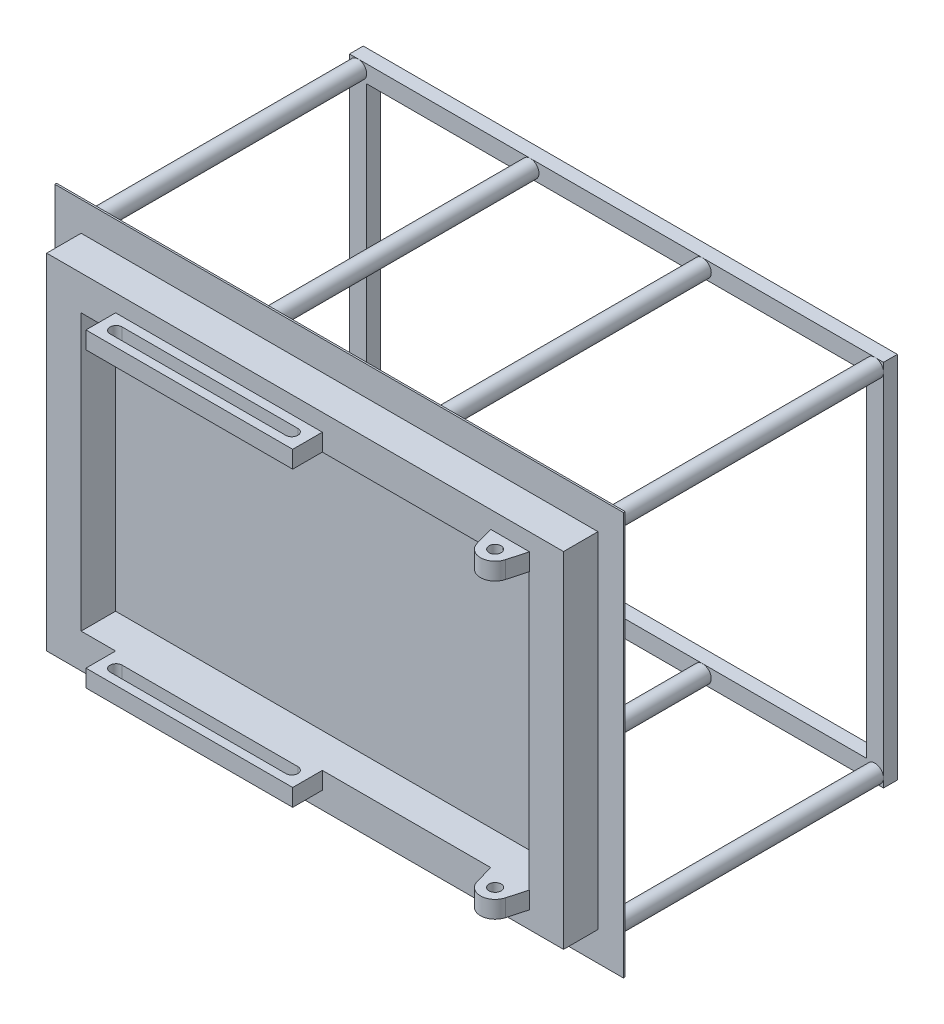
ISO-10303-21;
HEADER;
FILE_DESCRIPTION(('STEP AP214'),'2;1');
FILE_NAME('part.step','',(''),(''),'','','');
FILE_SCHEMA(('AUTOMOTIVE_DESIGN { 1 0 10303 214 1 1 1 1 }'));
ENDSEC;
DATA;
#1=APPLICATION_CONTEXT('core data for automotive mechanical design processes');
#2=APPLICATION_PROTOCOL_DEFINITION('international standard','automotive_design',2000,#1);
#3=PRODUCT_CONTEXT('',#1,'mechanical');
#4=PRODUCT('Part','Part','',(#3));
#5=PRODUCT_RELATED_PRODUCT_CATEGORY('part','',(#4));
#6=PRODUCT_DEFINITION_FORMATION('','',#4);
#7=PRODUCT_DEFINITION_CONTEXT('part definition',#1,'design');
#8=PRODUCT_DEFINITION('design','',#6,#7);
#9=PRODUCT_DEFINITION_SHAPE('','',#8);
#10=(LENGTH_UNIT() NAMED_UNIT(*) SI_UNIT(.MILLI.,.METRE.));
#11=(NAMED_UNIT(*) PLANE_ANGLE_UNIT() SI_UNIT($,.RADIAN.));
#12=(NAMED_UNIT(*) SI_UNIT($,.STERADIAN.) SOLID_ANGLE_UNIT());
#13=UNCERTAINTY_MEASURE_WITH_UNIT(LENGTH_MEASURE(1.E-05),#10,'distance_accuracy_value','');
#14=(GEOMETRIC_REPRESENTATION_CONTEXT(3) GLOBAL_UNCERTAINTY_ASSIGNED_CONTEXT((#13)) GLOBAL_UNIT_ASSIGNED_CONTEXT((#10,
#11,#12)) REPRESENTATION_CONTEXT('',''));
#15=CARTESIAN_POINT('',(0.,0.,0.));
#16=DIRECTION('',(0.,0.,1.));
#17=DIRECTION('',(1.,0.,0.));
#18=AXIS2_PLACEMENT_3D('',#15,#16,#17);
#19=CARTESIAN_POINT('',(-1652.5,-1170.,-110.));
#20=DIRECTION('',(0.,0.,-1.));
#21=DIRECTION('',(-1.,0.,0.));
#22=AXIS2_PLACEMENT_3D('',#19,#20,#21);
#23=PLANE('',#22);
#24=CARTESIAN_POINT('',(-502.5,-1020.,-110.));
#25=DIRECTION('',(0.,0.,-1.));
#26=DIRECTION('',(-1.,0.,0.));
#27=AXIS2_PLACEMENT_3D('',#24,#25,#26);
#28=CIRCLE('',#27,50.);
#29=CARTESIAN_POINT('',(-552.5,-1020.,-110.));
#30=VERTEX_POINT('',#29);
#31=EDGE_CURVE('E509',#30,#30,#28,.T.);
#32=ORIENTED_EDGE('',*,*,#31,.F.);
#33=EDGE_LOOP('',(#32));
#34=FACE_BOUND('',#33,.T.);
#35=CARTESIAN_POINT('',(1497.5,-1020.,-110.));
#36=DIRECTION('',(0.,0.,-1.));
#37=DIRECTION('',(-1.,0.,0.));
#38=AXIS2_PLACEMENT_3D('',#35,#36,#37);
#39=CIRCLE('',#38,50.);
#40=CARTESIAN_POINT('',(1447.5,-1020.,-110.));
#41=VERTEX_POINT('',#40);
#42=EDGE_CURVE('E521',#41,#41,#39,.T.);
#43=ORIENTED_EDGE('',*,*,#42,.F.);
#44=EDGE_LOOP('',(#43));
#45=FACE_BOUND('',#44,.T.);
#46=CARTESIAN_POINT('',(-1502.5,1020.,-110.));
#47=DIRECTION('',(0.,0.,-1.));
#48=DIRECTION('',(-1.,0.,0.));
#49=AXIS2_PLACEMENT_3D('',#46,#47,#48);
#50=CIRCLE('',#49,50.);
#51=CARTESIAN_POINT('',(-1552.5,1020.,-110.));
#52=VERTEX_POINT('',#51);
#53=EDGE_CURVE('E534',#52,#52,#50,.T.);
#54=ORIENTED_EDGE('',*,*,#53,.F.);
#55=EDGE_LOOP('',(#54));
#56=FACE_BOUND('',#55,.T.);
#57=DIRECTION('',(0.,-1.,0.));
#58=VECTOR('',#57,1.);
#59=CARTESIAN_POINT('',(-1652.5,1170.,-110.));
#60=LINE('',#59,#58);
#61=CARTESIAN_POINT('',(-1652.5,1170.,-110.));
#62=VERTEX_POINT('',#61);
#63=CARTESIAN_POINT('',(-1652.5,-1170.,-110.));
#64=VERTEX_POINT('',#63);
#65=EDGE_CURVE('E540',#62,#64,#60,.T.);
#66=ORIENTED_EDGE('',*,*,#65,.F.);
#67=DIRECTION('',(1.,0.,0.));
#68=VECTOR('',#67,1.);
#69=CARTESIAN_POINT('',(-1652.5,1170.,-110.));
#70=LINE('',#69,#68);
#71=CARTESIAN_POINT('',(1647.5,1170.,-110.));
#72=VERTEX_POINT('',#71);
#73=EDGE_CURVE('E549',#62,#72,#70,.T.);
#74=ORIENTED_EDGE('',*,*,#73,.T.);
#75=DIRECTION('',(0.,1.,0.));
#76=VECTOR('',#75,1.);
#77=CARTESIAN_POINT('',(1647.5,-1170.,-110.));
#78=LINE('',#77,#76);
#79=CARTESIAN_POINT('',(1647.5,-1170.,-110.));
#80=VERTEX_POINT('',#79);
#81=EDGE_CURVE('E546',#80,#72,#78,.T.);
#82=ORIENTED_EDGE('',*,*,#81,.F.);
#83=DIRECTION('',(-1.,0.,0.));
#84=VECTOR('',#83,1.);
#85=CARTESIAN_POINT('',(1647.5,-1170.,-110.));
#86=LINE('',#85,#84);
#87=EDGE_CURVE('E543',#80,#64,#86,.T.);
#88=ORIENTED_EDGE('',*,*,#87,.T.);
#89=EDGE_LOOP('',(#66,#74,#82,#88));
#90=FACE_BOUND('',#89,.T.);
#91=CARTESIAN_POINT('',(-502.5,1020.,-110.));
#92=DIRECTION('',(0.,0.,-1.));
#93=DIRECTION('',(-1.,0.,0.));
#94=AXIS2_PLACEMENT_3D('',#91,#92,#93);
#95=CIRCLE('',#94,50.);
#96=CARTESIAN_POINT('',(-552.5,1020.,-110.));
#97=VERTEX_POINT('',#96);
#98=EDGE_CURVE('E528',#97,#97,#95,.T.);
#99=ORIENTED_EDGE('',*,*,#98,.F.);
#100=EDGE_LOOP('',(#99));
#101=FACE_BOUND('',#100,.T.);
#102=CARTESIAN_POINT('',(497.5,1020.,-110.));
#103=DIRECTION('',(0.,0.,-1.));
#104=DIRECTION('',(-1.,0.,0.));
#105=AXIS2_PLACEMENT_3D('',#102,#103,#104);
#106=CIRCLE('',#105,50.);
#107=CARTESIAN_POINT('',(447.5,1020.,-110.));
#108=VERTEX_POINT('',#107);
#109=EDGE_CURVE('E771',#108,#108,#106,.T.);
#110=ORIENTED_EDGE('',*,*,#109,.F.);
#111=EDGE_LOOP('',(#110));
#112=FACE_BOUND('',#111,.T.);
#113=CARTESIAN_POINT('',(1497.5,1020.,-110.));
#114=DIRECTION('',(0.,0.,-1.));
#115=DIRECTION('',(-1.,0.,0.));
#116=AXIS2_PLACEMENT_3D('',#113,#114,#115);
#117=CIRCLE('',#116,50.);
#118=CARTESIAN_POINT('',(1447.5,1020.,-110.));
#119=VERTEX_POINT('',#118);
#120=EDGE_CURVE('E41',#119,#119,#117,.T.);
#121=ORIENTED_EDGE('',*,*,#120,.F.);
#122=EDGE_LOOP('',(#121));
#123=FACE_BOUND('',#122,.T.);
#124=CARTESIAN_POINT('',(-1502.5,-1020.,-110.));
#125=DIRECTION('',(0.,0.,-1.));
#126=DIRECTION('',(-1.,0.,0.));
#127=AXIS2_PLACEMENT_3D('',#124,#125,#126);
#128=CIRCLE('',#127,50.);
#129=CARTESIAN_POINT('',(-1552.5,-1020.,-110.));
#130=VERTEX_POINT('',#129);
#131=EDGE_CURVE('E515',#130,#130,#128,.T.);
#132=ORIENTED_EDGE('',*,*,#131,.F.);
#133=EDGE_LOOP('',(#132));
#134=FACE_BOUND('',#133,.T.);
#135=CARTESIAN_POINT('',(497.5,-1020.,-110.));
#136=DIRECTION('',(0.,0.,-1.));
#137=DIRECTION('',(-1.,0.,0.));
#138=AXIS2_PLACEMENT_3D('',#135,#136,#137);
#139=CIRCLE('',#138,50.);
#140=CARTESIAN_POINT('',(447.5,-1020.,-110.));
#141=VERTEX_POINT('',#140);
#142=EDGE_CURVE('E502',#141,#141,#139,.T.);
#143=ORIENTED_EDGE('',*,*,#142,.F.);
#144=EDGE_LOOP('',(#143));
#145=FACE_BOUND('',#144,.T.);
#146=ADVANCED_FACE('F33',(#34,#45,#56,#90,#101,#112,#123,#134,#145),#23,.T.);
#147=CARTESIAN_POINT('',(-1500.,1000.,100.));
#148=DIRECTION('',(0.,0.,1.));
#149=DIRECTION('',(1.,0.,0.));
#150=AXIS2_PLACEMENT_3D('',#147,#148,#149);
#151=PLANE('',#150);
#152=DIRECTION('',(-1.,0.,0.));
#153=VECTOR('',#152,1.);
#154=CARTESIAN_POINT('',(1302.5,-800.,100.));
#155=LINE('',#154,#153);
#156=CARTESIAN_POINT('',(1302.5,-800.,100.));
#157=VERTEX_POINT('',#156);
#158=CARTESIAN_POINT('',(1300.,-800.,100.));
#159=VERTEX_POINT('',#158);
#160=EDGE_CURVE('E573',#157,#159,#155,.T.);
#161=ORIENTED_EDGE('',*,*,#160,.F.);
#162=DIRECTION('',(0.,1.,0.));
#163=VECTOR('',#162,1.);
#164=CARTESIAN_POINT('',(1302.5,-900.,100.));
#165=LINE('',#164,#163);
#166=CARTESIAN_POINT('',(1302.5,-900.,100.));
#167=VERTEX_POINT('',#166);
#168=EDGE_CURVE('E603',#167,#157,#165,.T.);
#169=ORIENTED_EDGE('',*,*,#168,.F.);
#170=DIRECTION('',(-1.,0.,0.));
#171=VECTOR('',#170,1.);
#172=CARTESIAN_POINT('',(1302.5,-900.,100.));
#173=LINE('',#172,#171);
#174=CARTESIAN_POINT('',(1077.5,-900.,100.));
#175=VERTEX_POINT('',#174);
#176=EDGE_CURVE('E576',#167,#175,#173,.T.);
#177=ORIENTED_EDGE('',*,*,#176,.T.);
#178=DIRECTION('',(0.,1.,0.));
#179=VECTOR('',#178,1.);
#180=CARTESIAN_POINT('',(1077.5,-900.,100.));
#181=LINE('',#180,#179);
#182=CARTESIAN_POINT('',(1077.5,-800.,100.));
#183=VERTEX_POINT('',#182);
#184=EDGE_CURVE('E586',#175,#183,#181,.T.);
#185=ORIENTED_EDGE('',*,*,#184,.T.);
#186=DIRECTION('',(-1.,0.,0.));
#187=VECTOR('',#186,1.);
#188=CARTESIAN_POINT('',(1300.,-800.,100.));
#189=LINE('',#188,#187);
#190=CARTESIAN_POINT('',(99.9999999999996,-800.,100.));
#191=VERTEX_POINT('',#190);
#192=EDGE_CURVE('E1214',#183,#191,#189,.T.);
#193=ORIENTED_EDGE('',*,*,#192,.T.);
#194=DIRECTION('',(0.,1.,0.));
#195=VECTOR('',#194,1.);
#196=CARTESIAN_POINT('',(99.9999999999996,-900.,100.));
#197=LINE('',#196,#195);
#198=CARTESIAN_POINT('',(99.9999999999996,-900.,100.));
#199=VERTEX_POINT('',#198);
#200=EDGE_CURVE('E699',#199,#191,#197,.T.);
#201=ORIENTED_EDGE('',*,*,#200,.F.);
#202=DIRECTION('',(1.,0.,0.));
#203=VECTOR('',#202,1.);
#204=CARTESIAN_POINT('',(-1100.,-900.,100.));
#205=LINE('',#204,#203);
#206=CARTESIAN_POINT('',(-1100.,-899.999999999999,100.));
#207=VERTEX_POINT('',#206);
#208=EDGE_CURVE('E679',#207,#199,#205,.T.);
#209=ORIENTED_EDGE('',*,*,#208,.F.);
#210=DIRECTION('',(0.,1.,0.));
#211=VECTOR('',#210,1.);
#212=CARTESIAN_POINT('',(-1100.,-900.,100.));
#213=LINE('',#212,#211);
#214=CARTESIAN_POINT('',(-1100.,-800.,100.));
#215=VERTEX_POINT('',#214);
#216=EDGE_CURVE('E702',#207,#215,#213,.T.);
#217=ORIENTED_EDGE('',*,*,#216,.T.);
#218=CARTESIAN_POINT('',(-1300.,-800.,100.));
#219=VERTEX_POINT('',#218);
#220=EDGE_CURVE('E1212',#215,#219,#189,.T.);
#221=ORIENTED_EDGE('',*,*,#220,.T.);
#222=DIRECTION('',(0.,-1.,0.));
#223=VECTOR('',#222,1.);
#224=CARTESIAN_POINT('',(-1300.,800.,100.));
#225=LINE('',#224,#223);
#226=CARTESIAN_POINT('',(-1300.,800.,100.));
#227=VERTEX_POINT('',#226);
#228=EDGE_CURVE('E1175',#227,#219,#225,.T.);
#229=ORIENTED_EDGE('',*,*,#228,.F.);
#230=DIRECTION('',(1.,0.,0.));
#231=VECTOR('',#230,1.);
#232=CARTESIAN_POINT('',(-1300.,800.,100.));
#233=LINE('',#232,#231);
#234=CARTESIAN_POINT('',(-1100.,800.,100.));
#235=VERTEX_POINT('',#234);
#236=EDGE_CURVE('E1152',#227,#235,#233,.T.);
#237=ORIENTED_EDGE('',*,*,#236,.T.);
#238=DIRECTION('',(0.,-1.,0.));
#239=VECTOR('',#238,1.);
#240=CARTESIAN_POINT('',(-1100.,900.,100.));
#241=LINE('',#240,#239);
#242=CARTESIAN_POINT('',(-1100.,900.,100.));
#243=VERTEX_POINT('',#242);
#244=EDGE_CURVE('E749',#243,#235,#241,.T.);
#245=ORIENTED_EDGE('',*,*,#244,.F.);
#246=DIRECTION('',(1.,0.,0.));
#247=VECTOR('',#246,1.);
#248=CARTESIAN_POINT('',(-1100.,900.,100.));
#249=LINE('',#248,#247);
#250=CARTESIAN_POINT('',(99.9999999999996,900.,100.));
#251=VERTEX_POINT('',#250);
#252=EDGE_CURVE('E746',#243,#251,#249,.T.);
#253=ORIENTED_EDGE('',*,*,#252,.T.);
#254=DIRECTION('',(0.,-1.,0.));
#255=VECTOR('',#254,1.);
#256=CARTESIAN_POINT('',(99.9999999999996,900.,100.));
#257=LINE('',#256,#255);
#258=CARTESIAN_POINT('',(99.9999999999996,800.,100.));
#259=VERTEX_POINT('',#258);
#260=EDGE_CURVE('E758',#251,#259,#257,.T.);
#261=ORIENTED_EDGE('',*,*,#260,.T.);
#262=CARTESIAN_POINT('',(1077.5,800.,100.));
#263=VERTEX_POINT('',#262);
#264=EDGE_CURVE('E1157',#259,#263,#233,.T.);
#265=ORIENTED_EDGE('',*,*,#264,.T.);
#266=DIRECTION('',(0.,-1.,0.));
#267=VECTOR('',#266,1.);
#268=CARTESIAN_POINT('',(1077.5,900.,100.));
#269=LINE('',#268,#267);
#270=CARTESIAN_POINT('',(1077.5,900.,100.));
#271=VERTEX_POINT('',#270);
#272=EDGE_CURVE('E641',#271,#263,#269,.T.);
#273=ORIENTED_EDGE('',*,*,#272,.F.);
#274=DIRECTION('',(-1.,0.,0.));
#275=VECTOR('',#274,1.);
#276=CARTESIAN_POINT('',(1302.5,900.,100.));
#277=LINE('',#276,#275);
#278=CARTESIAN_POINT('',(1302.5,900.,100.));
#279=VERTEX_POINT('',#278);
#280=EDGE_CURVE('E613',#279,#271,#277,.T.);
#281=ORIENTED_EDGE('',*,*,#280,.F.);
#282=DIRECTION('',(0.,-1.,0.));
#283=VECTOR('',#282,1.);
#284=CARTESIAN_POINT('',(1302.5,900.,100.));
#285=LINE('',#284,#283);
#286=CARTESIAN_POINT('',(1302.5,800.,100.));
#287=VERTEX_POINT('',#286);
#288=EDGE_CURVE('E625',#279,#287,#285,.T.);
#289=ORIENTED_EDGE('',*,*,#288,.T.);
#290=DIRECTION('',(-1.,0.,0.));
#291=VECTOR('',#290,1.);
#292=CARTESIAN_POINT('',(1302.5,800.,100.));
#293=LINE('',#292,#291);
#294=CARTESIAN_POINT('',(1300.,800.,100.));
#295=VERTEX_POINT('',#294);
#296=EDGE_CURVE('E610',#287,#295,#293,.T.);
#297=ORIENTED_EDGE('',*,*,#296,.T.);
#298=DIRECTION('',(0.,1.,0.));
#299=VECTOR('',#298,1.);
#300=CARTESIAN_POINT('',(1300.,-800.,100.));
#301=LINE('',#300,#299);
#302=EDGE_CURVE('E1161',#159,#295,#301,.T.);
#303=ORIENTED_EDGE('',*,*,#302,.F.);
#304=EDGE_LOOP('',(#161,#169,#177,#185,#193,#201,#209,#217,#221,#229,#237,#245,#253,#261,#265,
#273,#281,#289,#297,#303));
#305=FACE_BOUND('',#304,.T.);
#306=DIRECTION('',(0.,-1.,0.));
#307=VECTOR('',#306,1.);
#308=CARTESIAN_POINT('',(-1500.,1000.,100.));
#309=LINE('',#308,#307);
#310=CARTESIAN_POINT('',(-1500.,1000.,100.));
#311=VERTEX_POINT('',#310);
#312=CARTESIAN_POINT('',(-1500.,-1000.,100.));
#313=VERTEX_POINT('',#312);
#314=EDGE_CURVE('E1142',#311,#313,#309,.T.);
#315=ORIENTED_EDGE('',*,*,#314,.T.);
#316=DIRECTION('',(-1.,0.,0.));
#317=VECTOR('',#316,1.);
#318=CARTESIAN_POINT('',(1500.,-1000.,100.));
#319=LINE('',#318,#317);
#320=CARTESIAN_POINT('',(1500.,-1000.,100.));
#321=VERTEX_POINT('',#320);
#322=EDGE_CURVE('E1187',#321,#313,#319,.T.);
#323=ORIENTED_EDGE('',*,*,#322,.F.);
#324=DIRECTION('',(0.,1.,0.));
#325=VECTOR('',#324,1.);
#326=CARTESIAN_POINT('',(1500.,-1000.,100.));
#327=LINE('',#326,#325);
#328=CARTESIAN_POINT('',(1500.,1000.,100.));
#329=VERTEX_POINT('',#328);
#330=EDGE_CURVE('E1190',#321,#329,#327,.T.);
#331=ORIENTED_EDGE('',*,*,#330,.T.);
#332=DIRECTION('',(1.,0.,0.));
#333=VECTOR('',#332,1.);
#334=CARTESIAN_POINT('',(-1500.,1000.,100.));
#335=LINE('',#334,#333);
#336=EDGE_CURVE('E1146',#311,#329,#335,.T.);
#337=ORIENTED_EDGE('',*,*,#336,.F.);
#338=EDGE_LOOP('',(#315,#323,#331,#337));
#339=FACE_BOUND('',#338,.T.);
#340=ADVANCED_FACE('F784',(#305,#339),#151,.T.);
#341=CARTESIAN_POINT('',(-1500.,1000.,100.));
#342=DIRECTION('',(1.,0.,0.));
#343=DIRECTION('',(0.,1.,0.));
#344=AXIS2_PLACEMENT_3D('',#341,#342,#343);
#345=PLANE('',#344);
#346=DIRECTION('',(0.,-1.,0.));
#347=VECTOR('',#346,1.);
#348=CARTESIAN_POINT('',(-1500.,1000.,-100.));
#349=LINE('',#348,#347);
#350=CARTESIAN_POINT('',(-1500.,1000.,-100.));
#351=VERTEX_POINT('',#350);
#352=CARTESIAN_POINT('',(-1500.,-1000.,-100.));
#353=VERTEX_POINT('',#352);
#354=EDGE_CURVE('E1132',#351,#353,#349,.T.);
#355=ORIENTED_EDGE('',*,*,#354,.T.);
#356=DIRECTION('',(0.,0.,-1.));
#357=VECTOR('',#356,1.);
#358=CARTESIAN_POINT('',(-1500.,-1000.,100.));
#359=LINE('',#358,#357);
#360=EDGE_CURVE('E775',#313,#353,#359,.T.);
#361=ORIENTED_EDGE('',*,*,#360,.F.);
#362=ORIENTED_EDGE('',*,*,#314,.F.);
#363=DIRECTION('',(0.,0.,-1.));
#364=VECTOR('',#363,1.);
#365=CARTESIAN_POINT('',(-1500.,1000.,100.));
#366=LINE('',#365,#364);
#367=EDGE_CURVE('E1143',#311,#351,#366,.T.);
#368=ORIENTED_EDGE('',*,*,#367,.T.);
#369=EDGE_LOOP('',(#355,#361,#362,#368));
#370=FACE_BOUND('',#369,.T.);
#371=ADVANCED_FACE('F1011',(#370),#345,.F.);
#372=CARTESIAN_POINT('',(1500.,-1000.,100.));
#373=DIRECTION('',(0.,-1.,0.));
#374=DIRECTION('',(1.,0.,0.));
#375=AXIS2_PLACEMENT_3D('',#372,#373,#374);
#376=PLANE('',#375);
#377=DIRECTION('',(-1.,0.,0.));
#378=VECTOR('',#377,1.);
#379=CARTESIAN_POINT('',(1500.,-1000.,-100.));
#380=LINE('',#379,#378);
#381=CARTESIAN_POINT('',(1500.,-1000.,-100.));
#382=VERTEX_POINT('',#381);
#383=EDGE_CURVE('E1129',#382,#353,#380,.T.);
#384=ORIENTED_EDGE('',*,*,#383,.F.);
#385=DIRECTION('',(0.,0.,-1.));
#386=VECTOR('',#385,1.);
#387=CARTESIAN_POINT('',(1500.,-1000.,100.));
#388=LINE('',#387,#386);
#389=EDGE_CURVE('E1149',#321,#382,#388,.T.);
#390=ORIENTED_EDGE('',*,*,#389,.F.);
#391=ORIENTED_EDGE('',*,*,#322,.T.);
#392=ORIENTED_EDGE('',*,*,#360,.T.);
#393=EDGE_LOOP('',(#384,#390,#391,#392));
#394=FACE_BOUND('',#393,.T.);
#395=ADVANCED_FACE('F1019',(#394),#376,.T.);
#396=CARTESIAN_POINT('',(1500.,-1000.,100.));
#397=DIRECTION('',(-1.,0.,0.));
#398=DIRECTION('',(0.,-1.,0.));
#399=AXIS2_PLACEMENT_3D('',#396,#397,#398);
#400=PLANE('',#399);
#401=DIRECTION('',(0.,1.,0.));
#402=VECTOR('',#401,1.);
#403=CARTESIAN_POINT('',(1500.,-1000.,-100.));
#404=LINE('',#403,#402);
#405=CARTESIAN_POINT('',(1500.,1000.,-100.));
#406=VERTEX_POINT('',#405);
#407=EDGE_CURVE('E1133',#382,#406,#404,.T.);
#408=ORIENTED_EDGE('',*,*,#407,.T.);
#409=DIRECTION('',(0.,0.,-1.));
#410=VECTOR('',#409,1.);
#411=CARTESIAN_POINT('',(1500.,1000.,100.));
#412=LINE('',#411,#410);
#413=EDGE_CURVE('E1145',#329,#406,#412,.T.);
#414=ORIENTED_EDGE('',*,*,#413,.F.);
#415=ORIENTED_EDGE('',*,*,#330,.F.);
#416=ORIENTED_EDGE('',*,*,#389,.T.);
#417=EDGE_LOOP('',(#408,#414,#415,#416));
#418=FACE_BOUND('',#417,.T.);
#419=ADVANCED_FACE('F1015',(#418),#400,.F.);
#420=CARTESIAN_POINT('',(-1500.,1000.,100.));
#421=DIRECTION('',(0.,1.,0.));
#422=DIRECTION('',(-1.,0.,0.));
#423=AXIS2_PLACEMENT_3D('',#420,#421,#422);
#424=PLANE('',#423);
#425=DIRECTION('',(1.,0.,0.));
#426=VECTOR('',#425,1.);
#427=CARTESIAN_POINT('',(-1500.,1000.,-100.));
#428=LINE('',#427,#426);
#429=EDGE_CURVE('E1135',#351,#406,#428,.T.);
#430=ORIENTED_EDGE('',*,*,#429,.F.);
#431=ORIENTED_EDGE('',*,*,#367,.F.);
#432=ORIENTED_EDGE('',*,*,#336,.T.);
#433=ORIENTED_EDGE('',*,*,#413,.T.);
#434=EDGE_LOOP('',(#430,#431,#432,#433));
#435=FACE_BOUND('',#434,.T.);
#436=ADVANCED_FACE('F1007',(#435),#424,.T.);
#437=CARTESIAN_POINT('',(-1300.,800.,100.));
#438=DIRECTION('',(1.,0.,0.));
#439=DIRECTION('',(0.,0.,-1.));
#440=AXIS2_PLACEMENT_3D('',#437,#438,#439);
#441=PLANE('',#440);
#442=DIRECTION('',(0.,-1.,0.));
#443=VECTOR('',#442,1.);
#444=CARTESIAN_POINT('',(-1300.,800.,-100.));
#445=LINE('',#444,#443);
#446=CARTESIAN_POINT('',(-1300.,800.,-100.));
#447=VERTEX_POINT('',#446);
#448=CARTESIAN_POINT('',(-1300.,-800.,-100.));
#449=VERTEX_POINT('',#448);
#450=EDGE_CURVE('E1163',#447,#449,#445,.T.);
#451=ORIENTED_EDGE('',*,*,#450,.F.);
#452=DIRECTION('',(0.,0.,-1.));
#453=VECTOR('',#452,1.);
#454=CARTESIAN_POINT('',(-1300.,800.,100.));
#455=LINE('',#454,#453);
#456=EDGE_CURVE('E1156',#227,#447,#455,.T.);
#457=ORIENTED_EDGE('',*,*,#456,.F.);
#458=ORIENTED_EDGE('',*,*,#228,.T.);
#459=DIRECTION('',(0.,0.,-1.));
#460=VECTOR('',#459,1.);
#461=CARTESIAN_POINT('',(-1300.,-800.,100.));
#462=LINE('',#461,#460);
#463=EDGE_CURVE('E1137',#219,#449,#462,.T.);
#464=ORIENTED_EDGE('',*,*,#463,.T.);
#465=EDGE_LOOP('',(#451,#457,#458,#464));
#466=FACE_BOUND('',#465,.T.);
#467=ADVANCED_FACE('F1003',(#466),#441,.T.);
#468=CARTESIAN_POINT('',(1300.,-800.,100.));
#469=DIRECTION('',(0.,-1.,0.));
#470=DIRECTION('',(1.,0.,0.));
#471=AXIS2_PLACEMENT_3D('',#468,#469,#470);
#472=PLANE('',#471);
#473=DIRECTION('',(-1.,0.,0.));
#474=VECTOR('',#473,1.);
#475=CARTESIAN_POINT('',(1300.,-800.,-100.));
#476=LINE('',#475,#474);
#477=CARTESIAN_POINT('',(1300.,-800.,-100.));
#478=VERTEX_POINT('',#477);
#479=EDGE_CURVE('E1166',#478,#449,#476,.T.);
#480=ORIENTED_EDGE('',*,*,#479,.T.);
#481=ORIENTED_EDGE('',*,*,#463,.F.);
#482=ORIENTED_EDGE('',*,*,#220,.F.);
#483=DIRECTION('',(0.,0.,1.));
#484=VECTOR('',#483,1.);
#485=CARTESIAN_POINT('',(-1100.,-800.,100.));
#486=LINE('',#485,#484);
#487=CARTESIAN_POINT('',(-1100.,-800.,272.));
#488=VERTEX_POINT('',#487);
#489=EDGE_CURVE('E675',#215,#488,#486,.T.);
#490=ORIENTED_EDGE('',*,*,#489,.T.);
#491=DIRECTION('',(-1.,0.,0.));
#492=VECTOR('',#491,1.);
#493=CARTESIAN_POINT('',(99.9999999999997,-800.,272.));
#494=LINE('',#493,#492);
#495=CARTESIAN_POINT('',(99.9999999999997,-800.,272.));
#496=VERTEX_POINT('',#495);
#497=EDGE_CURVE('E680',#496,#488,#494,.T.);
#498=ORIENTED_EDGE('',*,*,#497,.F.);
#499=DIRECTION('',(0.,0.,-1.));
#500=VECTOR('',#499,1.);
#501=CARTESIAN_POINT('',(99.9999999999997,-800.,272.));
#502=LINE('',#501,#500);
#503=EDGE_CURVE('E691',#496,#191,#502,.T.);
#504=ORIENTED_EDGE('',*,*,#503,.T.);
#505=ORIENTED_EDGE('',*,*,#192,.F.);
#506=DIRECTION('',(0.268579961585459,0.,0.963257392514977));
#507=VECTOR('',#506,1.);
#508=CARTESIAN_POINT('',(1077.5,-800.,100.));
#509=LINE('',#508,#507);
#510=CARTESIAN_POINT('',(1108.12312163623,-800.,209.829296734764));
#511=VERTEX_POINT('',#510);
#512=EDGE_CURVE('E579',#183,#511,#509,.T.);
#513=ORIENTED_EDGE('',*,*,#512,.T.);
#514=CARTESIAN_POINT('',(1190.,-800.,187.));
#515=DIRECTION('',(0.,-1.,0.));
#516=DIRECTION('',(1.,0.,0.));
#517=AXIS2_PLACEMENT_3D('',#514,#515,#516);
#518=CIRCLE('',#517,85.);
#519=CARTESIAN_POINT('',(1271.87687836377,-800.,209.829296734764));
#520=VERTEX_POINT('',#519);
#521=EDGE_CURVE('E591',#520,#511,#518,.T.);
#522=ORIENTED_EDGE('',*,*,#521,.F.);
#523=DIRECTION('',(-0.268579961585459,0.,0.963257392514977));
#524=VECTOR('',#523,1.);
#525=CARTESIAN_POINT('',(1302.5,-800.,100.));
#526=LINE('',#525,#524);
#527=EDGE_CURVE('E589',#157,#520,#526,.T.);
#528=ORIENTED_EDGE('',*,*,#527,.F.);
#529=ORIENTED_EDGE('',*,*,#160,.T.);
#530=DIRECTION('',(0.,0.,-1.));
#531=VECTOR('',#530,1.);
#532=CARTESIAN_POINT('',(1300.,-800.,100.));
#533=LINE('',#532,#531);
#534=EDGE_CURVE('E1181',#159,#478,#533,.T.);
#535=ORIENTED_EDGE('',*,*,#534,.T.);
#536=EDGE_LOOP('',(#480,#481,#482,#490,#498,#504,#505,#513,#522,#528,#529,#535));
#537=FACE_BOUND('',#536,.T.);
#538=CARTESIAN_POINT('',(-1010.,-800.,187.));
#539=DIRECTION('',(0.,1.,0.));
#540=DIRECTION('',(-1.,0.,0.));
#541=AXIS2_PLACEMENT_3D('',#538,#539,#540);
#542=CIRCLE('',#541,35.);
#543=CARTESIAN_POINT('',(-1010.,-800.,152.));
#544=VERTEX_POINT('',#543);
#545=CARTESIAN_POINT('',(-1010.,-800.,222.));
#546=VERTEX_POINT('',#545);
#547=EDGE_CURVE('E644',#544,#546,#542,.T.);
#548=ORIENTED_EDGE('',*,*,#547,.F.);
#549=DIRECTION('',(1.,0.,0.));
#550=VECTOR('',#549,1.);
#551=CARTESIAN_POINT('',(-1010.,-800.,152.));
#552=LINE('',#551,#550);
#553=CARTESIAN_POINT('',(9.99999999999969,-800.,152.));
#554=VERTEX_POINT('',#553);
#555=EDGE_CURVE('E659',#544,#554,#552,.T.);
#556=ORIENTED_EDGE('',*,*,#555,.T.);
#557=CARTESIAN_POINT('',(9.99999999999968,-800.,187.));
#558=DIRECTION('',(0.,1.,0.));
#559=DIRECTION('',(-1.,0.,0.));
#560=AXIS2_PLACEMENT_3D('',#557,#558,#559);
#561=CIRCLE('',#560,35.);
#562=CARTESIAN_POINT('',(9.99999999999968,-800.,222.));
#563=VERTEX_POINT('',#562);
#564=EDGE_CURVE('E662',#563,#554,#561,.T.);
#565=ORIENTED_EDGE('',*,*,#564,.F.);
#566=DIRECTION('',(1.,0.,0.));
#567=VECTOR('',#566,1.);
#568=CARTESIAN_POINT('',(-1010.,-800.,222.));
#569=LINE('',#568,#567);
#570=EDGE_CURVE('E649',#546,#563,#569,.T.);
#571=ORIENTED_EDGE('',*,*,#570,.F.);
#572=EDGE_LOOP('',(#548,#556,#565,#571));
#573=FACE_BOUND('',#572,.T.);
#574=CARTESIAN_POINT('',(1190.,-800.,187.));
#575=DIRECTION('',(0.,-1.,0.));
#576=DIRECTION('',(1.,0.,0.));
#577=AXIS2_PLACEMENT_3D('',#574,#575,#576);
#578=CIRCLE('',#577,35.0000000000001);
#579=CARTESIAN_POINT('',(1225.,-800.,187.));
#580=VERTEX_POINT('',#579);
#581=EDGE_CURVE('E564',#580,#580,#578,.T.);
#582=ORIENTED_EDGE('',*,*,#581,.T.);
#583=EDGE_LOOP('',(#582));
#584=FACE_BOUND('',#583,.T.);
#585=ADVANCED_FACE('F999',(#537,#573,#584),#472,.F.);
#586=CARTESIAN_POINT('',(1300.,-800.,100.));
#587=DIRECTION('',(-1.,0.,0.));
#588=DIRECTION('',(0.,0.,1.));
#589=AXIS2_PLACEMENT_3D('',#586,#587,#588);
#590=PLANE('',#589);
#591=DIRECTION('',(0.,1.,0.));
#592=VECTOR('',#591,1.);
#593=CARTESIAN_POINT('',(1300.,-800.,-100.));
#594=LINE('',#593,#592);
#595=CARTESIAN_POINT('',(1300.,800.,-100.));
#596=VERTEX_POINT('',#595);
#597=EDGE_CURVE('E1170',#478,#596,#594,.T.);
#598=ORIENTED_EDGE('',*,*,#597,.F.);
#599=ORIENTED_EDGE('',*,*,#534,.F.);
#600=ORIENTED_EDGE('',*,*,#302,.T.);
#601=DIRECTION('',(0.,0.,-1.));
#602=VECTOR('',#601,1.);
#603=CARTESIAN_POINT('',(1300.,800.,100.));
#604=LINE('',#603,#602);
#605=EDGE_CURVE('E1178',#295,#596,#604,.T.);
#606=ORIENTED_EDGE('',*,*,#605,.T.);
#607=EDGE_LOOP('',(#598,#599,#600,#606));
#608=FACE_BOUND('',#607,.T.);
#609=ADVANCED_FACE('F995',(#608),#590,.T.);
#610=CARTESIAN_POINT('',(-1300.,800.,100.));
#611=DIRECTION('',(0.,1.,0.));
#612=DIRECTION('',(-1.,0.,0.));
#613=AXIS2_PLACEMENT_3D('',#610,#611,#612);
#614=PLANE('',#613);
#615=DIRECTION('',(1.,0.,0.));
#616=VECTOR('',#615,1.);
#617=CARTESIAN_POINT('',(-1300.,800.,-100.));
#618=LINE('',#617,#616);
#619=EDGE_CURVE('E1172',#447,#596,#618,.T.);
#620=ORIENTED_EDGE('',*,*,#619,.T.);
#621=ORIENTED_EDGE('',*,*,#605,.F.);
#622=ORIENTED_EDGE('',*,*,#296,.F.);
#623=DIRECTION('',(-0.268579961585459,0.,0.963257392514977));
#624=VECTOR('',#623,1.);
#625=CARTESIAN_POINT('',(1302.5,800.,100.));
#626=LINE('',#625,#624);
#627=CARTESIAN_POINT('',(1271.87687836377,800.,209.829296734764));
#628=VERTEX_POINT('',#627);
#629=EDGE_CURVE('E617',#287,#628,#626,.T.);
#630=ORIENTED_EDGE('',*,*,#629,.T.);
#631=CARTESIAN_POINT('',(1190.,800.,187.));
#632=DIRECTION('',(0.,-1.,0.));
#633=DIRECTION('',(1.,0.,0.));
#634=AXIS2_PLACEMENT_3D('',#631,#632,#633);
#635=CIRCLE('',#634,85.);
#636=CARTESIAN_POINT('',(1108.12312163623,800.,209.829296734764));
#637=VERTEX_POINT('',#636);
#638=EDGE_CURVE('E631',#628,#637,#635,.T.);
#639=ORIENTED_EDGE('',*,*,#638,.T.);
#640=DIRECTION('',(0.268579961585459,0.,0.963257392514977));
#641=VECTOR('',#640,1.);
#642=CARTESIAN_POINT('',(1077.5,800.,100.));
#643=LINE('',#642,#641);
#644=EDGE_CURVE('E628',#263,#637,#643,.T.);
#645=ORIENTED_EDGE('',*,*,#644,.F.);
#646=ORIENTED_EDGE('',*,*,#264,.F.);
#647=DIRECTION('',(0.,0.,-1.));
#648=VECTOR('',#647,1.);
#649=CARTESIAN_POINT('',(99.9999999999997,800.,272.));
#650=LINE('',#649,#648);
#651=CARTESIAN_POINT('',(99.9999999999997,800.,272.));
#652=VERTEX_POINT('',#651);
#653=EDGE_CURVE('E741',#652,#259,#650,.T.);
#654=ORIENTED_EDGE('',*,*,#653,.F.);
#655=DIRECTION('',(-1.,0.,0.));
#656=VECTOR('',#655,1.);
#657=CARTESIAN_POINT('',(99.9999999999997,800.,272.));
#658=LINE('',#657,#656);
#659=CARTESIAN_POINT('',(-1100.,800.,272.));
#660=VERTEX_POINT('',#659);
#661=EDGE_CURVE('E750',#652,#660,#658,.T.);
#662=ORIENTED_EDGE('',*,*,#661,.T.);
#663=DIRECTION('',(0.,0.,1.));
#664=VECTOR('',#663,1.);
#665=CARTESIAN_POINT('',(-1100.,800.,100.));
#666=LINE('',#665,#664);
#667=EDGE_CURVE('E737',#235,#660,#666,.T.);
#668=ORIENTED_EDGE('',*,*,#667,.F.);
#669=ORIENTED_EDGE('',*,*,#236,.F.);
#670=ORIENTED_EDGE('',*,*,#456,.T.);
#671=EDGE_LOOP('',(#620,#621,#622,#630,#639,#645,#646,#654,#662,#668,#669,#670));
#672=FACE_BOUND('',#671,.T.);
#673=DIRECTION('',(1.,0.,0.));
#674=VECTOR('',#673,1.);
#675=CARTESIAN_POINT('',(-1010.,800.,152.));
#676=LINE('',#675,#674);
#677=CARTESIAN_POINT('',(-1010.,800.,152.));
#678=VERTEX_POINT('',#677);
#679=CARTESIAN_POINT('',(9.99999999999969,800.,152.));
#680=VERTEX_POINT('',#679);
#681=EDGE_CURVE('E709',#678,#680,#676,.T.);
#682=ORIENTED_EDGE('',*,*,#681,.F.);
#683=CARTESIAN_POINT('',(-1010.,800.,187.));
#684=DIRECTION('',(0.,1.,0.));
#685=DIRECTION('',(-1.,0.,0.));
#686=AXIS2_PLACEMENT_3D('',#683,#684,#685);
#687=CIRCLE('',#686,35.);
#688=CARTESIAN_POINT('',(-1010.,800.,222.));
#689=VERTEX_POINT('',#688);
#690=EDGE_CURVE('E705',#678,#689,#687,.T.);
#691=ORIENTED_EDGE('',*,*,#690,.T.);
#692=DIRECTION('',(1.,0.,0.));
#693=VECTOR('',#692,1.);
#694=CARTESIAN_POINT('',(-1010.,800.,222.));
#695=LINE('',#694,#693);
#696=CARTESIAN_POINT('',(9.99999999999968,800.,222.));
#697=VERTEX_POINT('',#696);
#698=EDGE_CURVE('E720',#689,#697,#695,.T.);
#699=ORIENTED_EDGE('',*,*,#698,.T.);
#700=CARTESIAN_POINT('',(9.99999999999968,800.,187.));
#701=DIRECTION('',(0.,1.,0.));
#702=DIRECTION('',(-1.,0.,0.));
#703=AXIS2_PLACEMENT_3D('',#700,#701,#702);
#704=CIRCLE('',#703,35.);
#705=EDGE_CURVE('E723',#697,#680,#704,.T.);
#706=ORIENTED_EDGE('',*,*,#705,.T.);
#707=EDGE_LOOP('',(#682,#691,#699,#706));
#708=FACE_BOUND('',#707,.T.);
#709=CARTESIAN_POINT('',(1190.,800.,187.));
#710=DIRECTION('',(0.,-1.,0.));
#711=DIRECTION('',(1.,0.,0.));
#712=AXIS2_PLACEMENT_3D('',#709,#710,#711);
#713=CIRCLE('',#712,35.0000000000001);
#714=CARTESIAN_POINT('',(1225.,800.,187.));
#715=VERTEX_POINT('',#714);
#716=EDGE_CURVE('E606',#715,#715,#713,.T.);
#717=ORIENTED_EDGE('',*,*,#716,.F.);
#718=EDGE_LOOP('',(#717));
#719=FACE_BOUND('',#718,.T.);
#720=ADVANCED_FACE('F940',(#672,#708,#719),#614,.F.);
#721=CARTESIAN_POINT('',(-1100.,900.,272.));
#722=DIRECTION('',(0.,-1.,0.));
#723=DIRECTION('',(1.,0.,0.));
#724=AXIS2_PLACEMENT_3D('',#721,#722,#723);
#725=PLANE('',#724);
#726=DIRECTION('',(0.,0.,1.));
#727=VECTOR('',#726,1.);
#728=CARTESIAN_POINT('',(-1100.,900.,100.));
#729=LINE('',#728,#727);
#730=CARTESIAN_POINT('',(-1100.,900.,272.));
#731=VERTEX_POINT('',#730);
#732=EDGE_CURVE('E738',#243,#731,#729,.T.);
#733=ORIENTED_EDGE('',*,*,#732,.T.);
#734=DIRECTION('',(-1.,0.,0.));
#735=VECTOR('',#734,1.);
#736=CARTESIAN_POINT('',(99.9999999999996,900.,272.));
#737=LINE('',#736,#735);
#738=CARTESIAN_POINT('',(99.9999999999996,900.,272.));
#739=VERTEX_POINT('',#738);
#740=EDGE_CURVE('E740',#739,#731,#737,.T.);
#741=ORIENTED_EDGE('',*,*,#740,.F.);
#742=DIRECTION('',(0.,0.,-1.));
#743=VECTOR('',#742,1.);
#744=CARTESIAN_POINT('',(99.9999999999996,900.,272.));
#745=LINE('',#744,#743);
#746=EDGE_CURVE('E744',#739,#251,#745,.T.);
#747=ORIENTED_EDGE('',*,*,#746,.T.);
#748=ORIENTED_EDGE('',*,*,#252,.F.);
#749=EDGE_LOOP('',(#733,#741,#747,#748));
#750=FACE_BOUND('',#749,.T.);
#751=CARTESIAN_POINT('',(-1010.,900.,187.));
#752=DIRECTION('',(0.,1.,0.));
#753=DIRECTION('',(-1.,0.,0.));
#754=AXIS2_PLACEMENT_3D('',#751,#752,#753);
#755=CIRCLE('',#754,35.);
#756=CARTESIAN_POINT('',(-1010.,900.,152.));
#757=VERTEX_POINT('',#756);
#758=CARTESIAN_POINT('',(-1010.,900.,222.));
#759=VERTEX_POINT('',#758);
#760=EDGE_CURVE('E706',#757,#759,#755,.T.);
#761=ORIENTED_EDGE('',*,*,#760,.F.);
#762=DIRECTION('',(1.,0.,0.));
#763=VECTOR('',#762,1.);
#764=CARTESIAN_POINT('',(-1010.,900.,152.));
#765=LINE('',#764,#763);
#766=CARTESIAN_POINT('',(9.99999999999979,900.,152.));
#767=VERTEX_POINT('',#766);
#768=EDGE_CURVE('E714',#757,#767,#765,.T.);
#769=ORIENTED_EDGE('',*,*,#768,.T.);
#770=CARTESIAN_POINT('',(9.99999999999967,900.,187.));
#771=DIRECTION('',(0.,1.,0.));
#772=DIRECTION('',(-1.,0.,0.));
#773=AXIS2_PLACEMENT_3D('',#770,#771,#772);
#774=CIRCLE('',#773,35.);
#775=CARTESIAN_POINT('',(9.99999999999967,900.,222.));
#776=VERTEX_POINT('',#775);
#777=EDGE_CURVE('E711',#776,#767,#774,.T.);
#778=ORIENTED_EDGE('',*,*,#777,.F.);
#779=DIRECTION('',(1.,0.,0.));
#780=VECTOR('',#779,1.);
#781=CARTESIAN_POINT('',(-1010.,900.,222.));
#782=LINE('',#781,#780);
#783=EDGE_CURVE('E708',#759,#776,#782,.T.);
#784=ORIENTED_EDGE('',*,*,#783,.F.);
#785=EDGE_LOOP('',(#761,#769,#778,#784));
#786=FACE_BOUND('',#785,.T.);
#787=ADVANCED_FACE('F936',(#750,#786),#725,.F.);
#788=CARTESIAN_POINT('',(-1100.,900.,100.));
#789=DIRECTION('',(1.,0.,0.));
#790=DIRECTION('',(0.,1.,0.));
#791=AXIS2_PLACEMENT_3D('',#788,#789,#790);
#792=PLANE('',#791);
#793=ORIENTED_EDGE('',*,*,#667,.T.);
#794=DIRECTION('',(0.,-1.,0.));
#795=VECTOR('',#794,1.);
#796=CARTESIAN_POINT('',(-1100.,900.,272.));
#797=LINE('',#796,#795);
#798=EDGE_CURVE('E1258',#731,#660,#797,.T.);
#799=ORIENTED_EDGE('',*,*,#798,.F.);
#800=ORIENTED_EDGE('',*,*,#732,.F.);
#801=ORIENTED_EDGE('',*,*,#244,.T.);
#802=EDGE_LOOP('',(#793,#799,#800,#801));
#803=FACE_BOUND('',#802,.T.);
#804=ADVANCED_FACE('F939',(#803),#792,.F.);
#805=CARTESIAN_POINT('',(99.9999999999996,900.,272.));
#806=DIRECTION('',(0.,0.,1.));
#807=DIRECTION('',(1.,0.,0.));
#808=AXIS2_PLACEMENT_3D('',#805,#806,#807);
#809=PLANE('',#808);
#810=ORIENTED_EDGE('',*,*,#661,.F.);
#811=DIRECTION('',(0.,-1.,0.));
#812=VECTOR('',#811,1.);
#813=CARTESIAN_POINT('',(99.9999999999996,900.,272.));
#814=LINE('',#813,#812);
#815=EDGE_CURVE('E755',#739,#652,#814,.T.);
#816=ORIENTED_EDGE('',*,*,#815,.F.);
#817=ORIENTED_EDGE('',*,*,#740,.T.);
#818=ORIENTED_EDGE('',*,*,#798,.T.);
#819=EDGE_LOOP('',(#810,#816,#817,#818));
#820=FACE_BOUND('',#819,.T.);
#821=ADVANCED_FACE('F944',(#820),#809,.T.);
#822=CARTESIAN_POINT('',(99.9999999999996,900.,272.));
#823=DIRECTION('',(-1.,0.,0.));
#824=DIRECTION('',(0.,-1.,0.));
#825=AXIS2_PLACEMENT_3D('',#822,#823,#824);
#826=PLANE('',#825);
#827=ORIENTED_EDGE('',*,*,#653,.T.);
#828=ORIENTED_EDGE('',*,*,#260,.F.);
#829=ORIENTED_EDGE('',*,*,#746,.F.);
#830=ORIENTED_EDGE('',*,*,#815,.T.);
#831=EDGE_LOOP('',(#827,#828,#829,#830));
#832=FACE_BOUND('',#831,.T.);
#833=ADVANCED_FACE('F934',(#832),#826,.F.);
#834=CARTESIAN_POINT('',(-1010.,900.,187.));
#835=DIRECTION('',(0.,-1.,0.));
#836=DIRECTION('',(1.,0.,0.));
#837=AXIS2_PLACEMENT_3D('',#834,#835,#836);
#838=CYLINDRICAL_SURFACE('',#837,35.);
#839=ORIENTED_EDGE('',*,*,#690,.F.);
#840=DIRECTION('',(0.,-1.,0.));
#841=VECTOR('',#840,1.);
#842=CARTESIAN_POINT('',(-1010.,900.,152.));
#843=LINE('',#842,#841);
#844=EDGE_CURVE('E717',#757,#678,#843,.T.);
#845=ORIENTED_EDGE('',*,*,#844,.F.);
#846=ORIENTED_EDGE('',*,*,#760,.T.);
#847=DIRECTION('',(0.,-1.,0.));
#848=VECTOR('',#847,1.);
#849=CARTESIAN_POINT('',(-1010.,900.,222.));
#850=LINE('',#849,#848);
#851=EDGE_CURVE('E734',#759,#689,#850,.T.);
#852=ORIENTED_EDGE('',*,*,#851,.T.);
#853=EDGE_LOOP('',(#839,#845,#846,#852));
#854=FACE_BOUND('',#853,.T.);
#855=ADVANCED_FACE('F930',(#854),#838,.F.);
#856=CARTESIAN_POINT('',(-1010.,900.,222.));
#857=DIRECTION('',(0.,0.,-1.));
#858=DIRECTION('',(-1.,0.,0.));
#859=AXIS2_PLACEMENT_3D('',#856,#857,#858);
#860=PLANE('',#859);
#861=ORIENTED_EDGE('',*,*,#698,.F.);
#862=ORIENTED_EDGE('',*,*,#851,.F.);
#863=ORIENTED_EDGE('',*,*,#783,.T.);
#864=DIRECTION('',(0.,-1.,0.));
#865=VECTOR('',#864,1.);
#866=CARTESIAN_POINT('',(9.99999999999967,900.,222.));
#867=LINE('',#866,#865);
#868=EDGE_CURVE('E732',#776,#697,#867,.T.);
#869=ORIENTED_EDGE('',*,*,#868,.T.);
#870=EDGE_LOOP('',(#861,#862,#863,#869));
#871=FACE_BOUND('',#870,.T.);
#872=ADVANCED_FACE('F926',(#871),#860,.T.);
#873=CARTESIAN_POINT('',(9.99999999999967,900.,187.));
#874=DIRECTION('',(0.,-1.,0.));
#875=DIRECTION('',(1.,0.,0.));
#876=AXIS2_PLACEMENT_3D('',#873,#874,#875);
#877=CYLINDRICAL_SURFACE('',#876,35.);
#878=ORIENTED_EDGE('',*,*,#705,.F.);
#879=ORIENTED_EDGE('',*,*,#868,.F.);
#880=ORIENTED_EDGE('',*,*,#777,.T.);
#881=DIRECTION('',(0.,-1.,0.));
#882=VECTOR('',#881,1.);
#883=CARTESIAN_POINT('',(9.99999999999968,900.,152.));
#884=LINE('',#883,#882);
#885=EDGE_CURVE('E730',#767,#680,#884,.T.);
#886=ORIENTED_EDGE('',*,*,#885,.T.);
#887=EDGE_LOOP('',(#878,#879,#880,#886));
#888=FACE_BOUND('',#887,.T.);
#889=ADVANCED_FACE('F922',(#888),#877,.F.);
#890=CARTESIAN_POINT('',(-1010.,900.,152.));
#891=DIRECTION('',(0.,0.,-1.));
#892=DIRECTION('',(-1.,0.,0.));
#893=AXIS2_PLACEMENT_3D('',#890,#891,#892);
#894=PLANE('',#893);
#895=ORIENTED_EDGE('',*,*,#681,.T.);
#896=ORIENTED_EDGE('',*,*,#885,.F.);
#897=ORIENTED_EDGE('',*,*,#768,.F.);
#898=ORIENTED_EDGE('',*,*,#844,.T.);
#899=EDGE_LOOP('',(#895,#896,#897,#898));
#900=FACE_BOUND('',#899,.T.);
#901=ADVANCED_FACE('F918',(#900),#894,.F.);
#902=CARTESIAN_POINT('',(-1100.,-900.,100.));
#903=DIRECTION('',(-1.,0.,0.));
#904=DIRECTION('',(0.,-1.,0.));
#905=AXIS2_PLACEMENT_3D('',#902,#903,#904);
#906=PLANE('',#905);
#907=ORIENTED_EDGE('',*,*,#489,.F.);
#908=ORIENTED_EDGE('',*,*,#216,.F.);
#909=DIRECTION('',(0.,0.,1.));
#910=VECTOR('',#909,1.);
#911=CARTESIAN_POINT('',(-1100.,-900.,100.));
#912=LINE('',#911,#910);
#913=CARTESIAN_POINT('',(-1100.,-900.,272.));
#914=VERTEX_POINT('',#913);
#915=EDGE_CURVE('E676',#207,#914,#912,.T.);
#916=ORIENTED_EDGE('',*,*,#915,.T.);
#917=DIRECTION('',(0.,1.,0.));
#918=VECTOR('',#917,1.);
#919=CARTESIAN_POINT('',(-1100.,-900.,272.));
#920=LINE('',#919,#918);
#921=EDGE_CURVE('E688',#914,#488,#920,.T.);
#922=ORIENTED_EDGE('',*,*,#921,.T.);
#923=EDGE_LOOP('',(#907,#908,#916,#922));
#924=FACE_BOUND('',#923,.T.);
#925=ADVANCED_FACE('F914',(#924),#906,.T.);
#926=CARTESIAN_POINT('',(99.9999999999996,-900.,272.));
#927=DIRECTION('',(1.,0.,0.));
#928=DIRECTION('',(0.,1.,0.));
#929=AXIS2_PLACEMENT_3D('',#926,#927,#928);
#930=PLANE('',#929);
#931=ORIENTED_EDGE('',*,*,#503,.F.);
#932=DIRECTION('',(0.,1.,0.));
#933=VECTOR('',#932,1.);
#934=CARTESIAN_POINT('',(99.9999999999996,-900.,272.));
#935=LINE('',#934,#933);
#936=CARTESIAN_POINT('',(99.9999999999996,-900.,272.));
#937=VERTEX_POINT('',#936);
#938=EDGE_CURVE('E697',#937,#496,#935,.T.);
#939=ORIENTED_EDGE('',*,*,#938,.F.);
#940=DIRECTION('',(0.,0.,-1.));
#941=VECTOR('',#940,1.);
#942=CARTESIAN_POINT('',(99.9999999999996,-900.,272.));
#943=LINE('',#942,#941);
#944=EDGE_CURVE('E683',#937,#199,#943,.T.);
#945=ORIENTED_EDGE('',*,*,#944,.T.);
#946=ORIENTED_EDGE('',*,*,#200,.T.);
#947=EDGE_LOOP('',(#931,#939,#945,#946));
#948=FACE_BOUND('',#947,.T.);
#949=ADVANCED_FACE('F910',(#948),#930,.T.);
#950=CARTESIAN_POINT('',(99.9999999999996,-900.,272.));
#951=DIRECTION('',(0.,0.,-1.));
#952=DIRECTION('',(-1.,0.,0.));
#953=AXIS2_PLACEMENT_3D('',#950,#951,#952);
#954=PLANE('',#953);
#955=ORIENTED_EDGE('',*,*,#497,.T.);
#956=ORIENTED_EDGE('',*,*,#921,.F.);
#957=DIRECTION('',(-1.,0.,0.));
#958=VECTOR('',#957,1.);
#959=CARTESIAN_POINT('',(99.9999999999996,-900.,272.));
#960=LINE('',#959,#958);
#961=EDGE_CURVE('E686',#937,#914,#960,.T.);
#962=ORIENTED_EDGE('',*,*,#961,.F.);
#963=ORIENTED_EDGE('',*,*,#938,.T.);
#964=EDGE_LOOP('',(#955,#956,#962,#963));
#965=FACE_BOUND('',#964,.T.);
#966=ADVANCED_FACE('F906',(#965),#954,.F.);
#967=CARTESIAN_POINT('',(-1100.,-900.,272.));
#968=DIRECTION('',(0.,1.,0.));
#969=DIRECTION('',(1.,0.,0.));
#970=AXIS2_PLACEMENT_3D('',#967,#968,#969);
#971=PLANE('',#970);
#972=DIRECTION('',(1.,0.,0.));
#973=VECTOR('',#972,1.);
#974=CARTESIAN_POINT('',(-1010.,-900.,152.));
#975=LINE('',#974,#973);
#976=CARTESIAN_POINT('',(-1010.,-900.,152.));
#977=VERTEX_POINT('',#976);
#978=CARTESIAN_POINT('',(9.99999999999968,-900.,152.));
#979=VERTEX_POINT('',#978);
#980=EDGE_CURVE('E648',#977,#979,#975,.T.);
#981=ORIENTED_EDGE('',*,*,#980,.F.);
#982=CARTESIAN_POINT('',(-1010.,-900.,187.));
#983=DIRECTION('',(0.,1.,0.));
#984=DIRECTION('',(-1.,0.,0.));
#985=AXIS2_PLACEMENT_3D('',#982,#983,#984);
#986=CIRCLE('',#985,35.);
#987=CARTESIAN_POINT('',(-1010.,-900.,222.));
#988=VERTEX_POINT('',#987);
#989=EDGE_CURVE('E645',#977,#988,#986,.T.);
#990=ORIENTED_EDGE('',*,*,#989,.T.);
#991=DIRECTION('',(1.,0.,0.));
#992=VECTOR('',#991,1.);
#993=CARTESIAN_POINT('',(-1010.,-900.,222.));
#994=LINE('',#993,#992);
#995=CARTESIAN_POINT('',(9.99999999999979,-900.,222.));
#996=VERTEX_POINT('',#995);
#997=EDGE_CURVE('E654',#988,#996,#994,.T.);
#998=ORIENTED_EDGE('',*,*,#997,.T.);
#999=CARTESIAN_POINT('',(9.99999999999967,-900.,187.));
#1000=DIRECTION('',(0.,1.,0.));
#1001=DIRECTION('',(-1.,0.,0.));
#1002=AXIS2_PLACEMENT_3D('',#999,#1000,#1001);
#1003=CIRCLE('',#1002,35.);
#1004=EDGE_CURVE('E651',#996,#979,#1003,.T.);
#1005=ORIENTED_EDGE('',*,*,#1004,.T.);
#1006=EDGE_LOOP('',(#981,#990,#998,#1005));
#1007=FACE_BOUND('',#1006,.T.);
#1008=ORIENTED_EDGE('',*,*,#915,.F.);
#1009=ORIENTED_EDGE('',*,*,#208,.T.);
#1010=ORIENTED_EDGE('',*,*,#944,.F.);
#1011=ORIENTED_EDGE('',*,*,#961,.T.);
#1012=EDGE_LOOP('',(#1008,#1009,#1010,#1011));
#1013=FACE_BOUND('',#1012,.T.);
#1014=ADVANCED_FACE('F902',(#1007,#1013),#971,.F.);
#1015=CARTESIAN_POINT('',(-1010.,-900.,187.));
#1016=DIRECTION('',(0.,1.,0.));
#1017=DIRECTION('',(-1.,0.,0.));
#1018=AXIS2_PLACEMENT_3D('',#1015,#1016,#1017);
#1019=CYLINDRICAL_SURFACE('',#1018,35.);
#1020=ORIENTED_EDGE('',*,*,#547,.T.);
#1021=DIRECTION('',(0.,1.,0.));
#1022=VECTOR('',#1021,1.);
#1023=CARTESIAN_POINT('',(-1010.,-900.,222.));
#1024=LINE('',#1023,#1022);
#1025=EDGE_CURVE('E657',#988,#546,#1024,.T.);
#1026=ORIENTED_EDGE('',*,*,#1025,.F.);
#1027=ORIENTED_EDGE('',*,*,#989,.F.);
#1028=DIRECTION('',(0.,1.,0.));
#1029=VECTOR('',#1028,1.);
#1030=CARTESIAN_POINT('',(-1010.,-900.,152.));
#1031=LINE('',#1030,#1029);
#1032=EDGE_CURVE('E673',#977,#544,#1031,.T.);
#1033=ORIENTED_EDGE('',*,*,#1032,.T.);
#1034=EDGE_LOOP('',(#1020,#1026,#1027,#1033));
#1035=FACE_BOUND('',#1034,.T.);
#1036=ADVANCED_FACE('F898',(#1035),#1019,.F.);
#1037=CARTESIAN_POINT('',(-1010.,-900.,152.));
#1038=DIRECTION('',(0.,0.,1.));
#1039=DIRECTION('',(1.,0.,0.));
#1040=AXIS2_PLACEMENT_3D('',#1037,#1038,#1039);
#1041=PLANE('',#1040);
#1042=ORIENTED_EDGE('',*,*,#555,.F.);
#1043=ORIENTED_EDGE('',*,*,#1032,.F.);
#1044=ORIENTED_EDGE('',*,*,#980,.T.);
#1045=DIRECTION('',(0.,1.,0.));
#1046=VECTOR('',#1045,1.);
#1047=CARTESIAN_POINT('',(9.99999999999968,-900.,152.));
#1048=LINE('',#1047,#1046);
#1049=EDGE_CURVE('E671',#979,#554,#1048,.T.);
#1050=ORIENTED_EDGE('',*,*,#1049,.T.);
#1051=EDGE_LOOP('',(#1042,#1043,#1044,#1050));
#1052=FACE_BOUND('',#1051,.T.);
#1053=ADVANCED_FACE('F894',(#1052),#1041,.T.);
#1054=CARTESIAN_POINT('',(9.99999999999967,-900.,187.));
#1055=DIRECTION('',(0.,1.,0.));
#1056=DIRECTION('',(-1.,0.,0.));
#1057=AXIS2_PLACEMENT_3D('',#1054,#1055,#1056);
#1058=CYLINDRICAL_SURFACE('',#1057,35.);
#1059=ORIENTED_EDGE('',*,*,#564,.T.);
#1060=ORIENTED_EDGE('',*,*,#1049,.F.);
#1061=ORIENTED_EDGE('',*,*,#1004,.F.);
#1062=DIRECTION('',(0.,1.,0.));
#1063=VECTOR('',#1062,1.);
#1064=CARTESIAN_POINT('',(9.99999999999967,-900.,222.));
#1065=LINE('',#1064,#1063);
#1066=EDGE_CURVE('E669',#996,#563,#1065,.T.);
#1067=ORIENTED_EDGE('',*,*,#1066,.T.);
#1068=EDGE_LOOP('',(#1059,#1060,#1061,#1067));
#1069=FACE_BOUND('',#1068,.T.);
#1070=ADVANCED_FACE('F890',(#1069),#1058,.F.);
#1071=CARTESIAN_POINT('',(-1010.,-900.,222.));
#1072=DIRECTION('',(0.,0.,1.));
#1073=DIRECTION('',(1.,0.,0.));
#1074=AXIS2_PLACEMENT_3D('',#1071,#1072,#1073);
#1075=PLANE('',#1074);
#1076=ORIENTED_EDGE('',*,*,#570,.T.);
#1077=ORIENTED_EDGE('',*,*,#1066,.F.);
#1078=ORIENTED_EDGE('',*,*,#997,.F.);
#1079=ORIENTED_EDGE('',*,*,#1025,.T.);
#1080=EDGE_LOOP('',(#1076,#1077,#1078,#1079));
#1081=FACE_BOUND('',#1080,.T.);
#1082=ADVANCED_FACE('F886',(#1081),#1075,.F.);
#1083=CARTESIAN_POINT('',(1077.5,900.,100.));
#1084=DIRECTION('',(0.963257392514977,0.,-0.268579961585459));
#1085=DIRECTION('',(-0.268579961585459,0.,-0.963257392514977));
#1086=AXIS2_PLACEMENT_3D('',#1083,#1084,#1085);
#1087=PLANE('',#1086);
#1088=ORIENTED_EDGE('',*,*,#644,.T.);
#1089=DIRECTION('',(0.,-1.,0.));
#1090=VECTOR('',#1089,1.);
#1091=CARTESIAN_POINT('',(1108.12312163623,900.,209.829296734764));
#1092=LINE('',#1091,#1090);
#1093=CARTESIAN_POINT('',(1108.12312163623,900.,209.829296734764));
#1094=VERTEX_POINT('',#1093);
#1095=EDGE_CURVE('E639',#1094,#637,#1092,.T.);
#1096=ORIENTED_EDGE('',*,*,#1095,.F.);
#1097=DIRECTION('',(0.268579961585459,0.,0.963257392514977));
#1098=VECTOR('',#1097,1.);
#1099=CARTESIAN_POINT('',(1077.5,900.,100.));
#1100=LINE('',#1099,#1098);
#1101=EDGE_CURVE('E616',#271,#1094,#1100,.T.);
#1102=ORIENTED_EDGE('',*,*,#1101,.F.);
#1103=ORIENTED_EDGE('',*,*,#272,.T.);
#1104=EDGE_LOOP('',(#1088,#1096,#1102,#1103));
#1105=FACE_BOUND('',#1104,.T.);
#1106=ADVANCED_FACE('F882',(#1105),#1087,.F.);
#1107=CARTESIAN_POINT('',(1190.,900.,187.));
#1108=DIRECTION('',(0.,-1.,0.));
#1109=DIRECTION('',(1.,0.,0.));
#1110=AXIS2_PLACEMENT_3D('',#1107,#1108,#1109);
#1111=CYLINDRICAL_SURFACE('',#1110,85.);
#1112=ORIENTED_EDGE('',*,*,#638,.F.);
#1113=DIRECTION('',(0.,-1.,0.));
#1114=VECTOR('',#1113,1.);
#1115=CARTESIAN_POINT('',(1271.87687836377,900.,209.829296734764));
#1116=LINE('',#1115,#1114);
#1117=CARTESIAN_POINT('',(1271.87687836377,900.,209.829296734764));
#1118=VERTEX_POINT('',#1117);
#1119=EDGE_CURVE('E637',#1118,#628,#1116,.T.);
#1120=ORIENTED_EDGE('',*,*,#1119,.F.);
#1121=CARTESIAN_POINT('',(1190.,900.,187.));
#1122=DIRECTION('',(0.,-1.,0.));
#1123=DIRECTION('',(1.,0.,0.));
#1124=AXIS2_PLACEMENT_3D('',#1121,#1122,#1123);
#1125=CIRCLE('',#1124,85.);
#1126=EDGE_CURVE('E619',#1118,#1094,#1125,.T.);
#1127=ORIENTED_EDGE('',*,*,#1126,.T.);
#1128=ORIENTED_EDGE('',*,*,#1095,.T.);
#1129=EDGE_LOOP('',(#1112,#1120,#1127,#1128));
#1130=FACE_BOUND('',#1129,.T.);
#1131=ADVANCED_FACE('F878',(#1130),#1111,.T.);
#1132=CARTESIAN_POINT('',(1302.5,900.,100.));
#1133=DIRECTION('',(0.963257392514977,0.,0.268579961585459));
#1134=DIRECTION('',(0.268579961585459,0.,-0.963257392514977));
#1135=AXIS2_PLACEMENT_3D('',#1132,#1133,#1134);
#1136=PLANE('',#1135);
#1137=ORIENTED_EDGE('',*,*,#629,.F.);
#1138=ORIENTED_EDGE('',*,*,#288,.F.);
#1139=DIRECTION('',(-0.268579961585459,0.,0.963257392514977));
#1140=VECTOR('',#1139,1.);
#1141=CARTESIAN_POINT('',(1302.5,900.,100.));
#1142=LINE('',#1141,#1140);
#1143=EDGE_CURVE('E622',#279,#1118,#1142,.T.);
#1144=ORIENTED_EDGE('',*,*,#1143,.T.);
#1145=ORIENTED_EDGE('',*,*,#1119,.T.);
#1146=EDGE_LOOP('',(#1137,#1138,#1144,#1145));
#1147=FACE_BOUND('',#1146,.T.);
#1148=ADVANCED_FACE('F874',(#1147),#1136,.T.);
#1149=CARTESIAN_POINT('',(1190.,900.,187.));
#1150=DIRECTION('',(0.,-1.,0.));
#1151=DIRECTION('',(1.,0.,0.));
#1152=AXIS2_PLACEMENT_3D('',#1149,#1150,#1151);
#1153=PLANE('',#1152);
#1154=CARTESIAN_POINT('',(1190.,900.,187.));
#1155=DIRECTION('',(0.,-1.,0.));
#1156=DIRECTION('',(1.,0.,0.));
#1157=AXIS2_PLACEMENT_3D('',#1154,#1155,#1156);
#1158=CIRCLE('',#1157,35.0000000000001);
#1159=CARTESIAN_POINT('',(1225.,900.,187.));
#1160=VERTEX_POINT('',#1159);
#1161=EDGE_CURVE('E607',#1160,#1160,#1158,.T.);
#1162=ORIENTED_EDGE('',*,*,#1161,.T.);
#1163=EDGE_LOOP('',(#1162));
#1164=FACE_BOUND('',#1163,.T.);
#1165=ORIENTED_EDGE('',*,*,#280,.T.);
#1166=ORIENTED_EDGE('',*,*,#1101,.T.);
#1167=ORIENTED_EDGE('',*,*,#1126,.F.);
#1168=ORIENTED_EDGE('',*,*,#1143,.F.);
#1169=EDGE_LOOP('',(#1165,#1166,#1167,#1168));
#1170=FACE_BOUND('',#1169,.T.);
#1171=ADVANCED_FACE('F870',(#1164,#1170),#1153,.F.);
#1172=CARTESIAN_POINT('',(1190.,900.,187.));
#1173=DIRECTION('',(0.,-1.,0.));
#1174=DIRECTION('',(1.,0.,0.));
#1175=AXIS2_PLACEMENT_3D('',#1172,#1173,#1174);
#1176=CYLINDRICAL_SURFACE('',#1175,35.0000000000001);
#1177=ORIENTED_EDGE('',*,*,#1161,.F.);
#1178=EDGE_LOOP('',(#1177));
#1179=FACE_BOUND('',#1178,.T.);
#1180=ORIENTED_EDGE('',*,*,#716,.T.);
#1181=EDGE_LOOP('',(#1180));
#1182=FACE_BOUND('',#1181,.T.);
#1183=ADVANCED_FACE('F856',(#1179,#1182),#1176,.F.);
#1184=CARTESIAN_POINT('',(1190.,-900.,187.));
#1185=DIRECTION('',(0.,1.,0.));
#1186=DIRECTION('',(1.,0.,0.));
#1187=AXIS2_PLACEMENT_3D('',#1184,#1185,#1186);
#1188=PLANE('',#1187);
#1189=ORIENTED_EDGE('',*,*,#176,.F.);
#1190=DIRECTION('',(-0.268579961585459,0.,0.963257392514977));
#1191=VECTOR('',#1190,1.);
#1192=CARTESIAN_POINT('',(1302.5,-900.,100.));
#1193=LINE('',#1192,#1191);
#1194=CARTESIAN_POINT('',(1271.87687836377,-900.,209.829296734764));
#1195=VERTEX_POINT('',#1194);
#1196=EDGE_CURVE('E578',#167,#1195,#1193,.T.);
#1197=ORIENTED_EDGE('',*,*,#1196,.T.);
#1198=CARTESIAN_POINT('',(1190.,-900.,187.));
#1199=DIRECTION('',(0.,-1.,0.));
#1200=DIRECTION('',(1.,0.,0.));
#1201=AXIS2_PLACEMENT_3D('',#1198,#1199,#1200);
#1202=CIRCLE('',#1201,85.);
#1203=CARTESIAN_POINT('',(1108.12312163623,-900.,209.829296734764));
#1204=VERTEX_POINT('',#1203);
#1205=EDGE_CURVE('E581',#1195,#1204,#1202,.T.);
#1206=ORIENTED_EDGE('',*,*,#1205,.T.);
#1207=DIRECTION('',(0.268579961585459,0.,0.963257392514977));
#1208=VECTOR('',#1207,1.);
#1209=CARTESIAN_POINT('',(1077.5,-900.,100.));
#1210=LINE('',#1209,#1208);
#1211=EDGE_CURVE('E583',#175,#1204,#1210,.T.);
#1212=ORIENTED_EDGE('',*,*,#1211,.F.);
#1213=EDGE_LOOP('',(#1189,#1197,#1206,#1212));
#1214=FACE_BOUND('',#1213,.T.);
#1215=CARTESIAN_POINT('',(1190.,-900.,187.));
#1216=DIRECTION('',(0.,-1.,0.));
#1217=DIRECTION('',(1.,0.,0.));
#1218=AXIS2_PLACEMENT_3D('',#1215,#1216,#1217);
#1219=CIRCLE('',#1218,35.0000000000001);
#1220=CARTESIAN_POINT('',(1225.,-900.,187.));
#1221=VERTEX_POINT('',#1220);
#1222=EDGE_CURVE('E570',#1221,#1221,#1219,.T.);
#1223=ORIENTED_EDGE('',*,*,#1222,.F.);
#1224=EDGE_LOOP('',(#1223));
#1225=FACE_BOUND('',#1224,.T.);
#1226=ADVANCED_FACE('F852',(#1214,#1225),#1188,.F.);
#1227=CARTESIAN_POINT('',(1302.5,-900.,100.));
#1228=DIRECTION('',(-0.963257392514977,0.,-0.268579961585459));
#1229=DIRECTION('',(-0.268579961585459,0.,0.963257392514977));
#1230=AXIS2_PLACEMENT_3D('',#1227,#1228,#1229);
#1231=PLANE('',#1230);
#1232=ORIENTED_EDGE('',*,*,#527,.T.);
#1233=DIRECTION('',(0.,1.,0.));
#1234=VECTOR('',#1233,1.);
#1235=CARTESIAN_POINT('',(1271.87687836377,-900.,209.829296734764));
#1236=LINE('',#1235,#1234);
#1237=EDGE_CURVE('E600',#1195,#520,#1236,.T.);
#1238=ORIENTED_EDGE('',*,*,#1237,.F.);
#1239=ORIENTED_EDGE('',*,*,#1196,.F.);
#1240=ORIENTED_EDGE('',*,*,#168,.T.);
#1241=EDGE_LOOP('',(#1232,#1238,#1239,#1240));
#1242=FACE_BOUND('',#1241,.T.);
#1243=ADVANCED_FACE('F855',(#1242),#1231,.F.);
#1244=CARTESIAN_POINT('',(1190.,-900.,187.));
#1245=DIRECTION('',(0.,1.,0.));
#1246=DIRECTION('',(-1.,0.,0.));
#1247=AXIS2_PLACEMENT_3D('',#1244,#1245,#1246);
#1248=CYLINDRICAL_SURFACE('',#1247,85.);
#1249=ORIENTED_EDGE('',*,*,#521,.T.);
#1250=DIRECTION('',(0.,1.,0.));
#1251=VECTOR('',#1250,1.);
#1252=CARTESIAN_POINT('',(1108.12312163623,-900.,209.829296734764));
#1253=LINE('',#1252,#1251);
#1254=EDGE_CURVE('E598',#1204,#511,#1253,.T.);
#1255=ORIENTED_EDGE('',*,*,#1254,.F.);
#1256=ORIENTED_EDGE('',*,*,#1205,.F.);
#1257=ORIENTED_EDGE('',*,*,#1237,.T.);
#1258=EDGE_LOOP('',(#1249,#1255,#1256,#1257));
#1259=FACE_BOUND('',#1258,.T.);
#1260=ADVANCED_FACE('F860',(#1259),#1248,.T.);
#1261=CARTESIAN_POINT('',(1077.5,-900.,100.));
#1262=DIRECTION('',(-0.963257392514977,0.,0.268579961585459));
#1263=DIRECTION('',(0.268579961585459,0.,0.963257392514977));
#1264=AXIS2_PLACEMENT_3D('',#1261,#1262,#1263);
#1265=PLANE('',#1264);
#1266=ORIENTED_EDGE('',*,*,#512,.F.);
#1267=ORIENTED_EDGE('',*,*,#184,.F.);
#1268=ORIENTED_EDGE('',*,*,#1211,.T.);
#1269=ORIENTED_EDGE('',*,*,#1254,.T.);
#1270=EDGE_LOOP('',(#1266,#1267,#1268,#1269));
#1271=FACE_BOUND('',#1270,.T.);
#1272=ADVANCED_FACE('F850',(#1271),#1265,.T.);
#1273=CARTESIAN_POINT('',(1190.,-900.,187.));
#1274=DIRECTION('',(0.,1.,0.));
#1275=DIRECTION('',(-1.,0.,0.));
#1276=AXIS2_PLACEMENT_3D('',#1273,#1274,#1275);
#1277=CYLINDRICAL_SURFACE('',#1276,35.0000000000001);
#1278=ORIENTED_EDGE('',*,*,#1222,.T.);
#1279=EDGE_LOOP('',(#1278));
#1280=FACE_BOUND('',#1279,.T.);
#1281=ORIENTED_EDGE('',*,*,#581,.F.);
#1282=EDGE_LOOP('',(#1281));
#1283=FACE_BOUND('',#1282,.T.);
#1284=ADVANCED_FACE('F831',(#1280,#1283),#1277,.F.);
#1285=CARTESIAN_POINT('',(-1652.5,-1170.,-100.));
#1286=DIRECTION('',(0.,0.,-1.));
#1287=DIRECTION('',(-1.,0.,0.));
#1288=AXIS2_PLACEMENT_3D('',#1285,#1286,#1287);
#1289=PLANE('',#1288);
#1290=ORIENTED_EDGE('',*,*,#450,.T.);
#1291=ORIENTED_EDGE('',*,*,#479,.F.);
#1292=ORIENTED_EDGE('',*,*,#597,.T.);
#1293=ORIENTED_EDGE('',*,*,#619,.F.);
#1294=EDGE_LOOP('',(#1290,#1291,#1292,#1293));
#1295=FACE_BOUND('',#1294,.T.);
#1296=ADVANCED_FACE('F827',(#1295),#1289,.F.);
#1297=DIRECTION('',(0.,-1.,0.));
#1298=VECTOR('',#1297,1.);
#1299=CARTESIAN_POINT('',(-1652.5,1170.,-100.));
#1300=LINE('',#1299,#1298);
#1301=CARTESIAN_POINT('',(-1652.5,1170.,-100.));
#1302=VERTEX_POINT('',#1301);
#1303=CARTESIAN_POINT('',(-1652.5,-1170.,-100.));
#1304=VERTEX_POINT('',#1303);
#1305=EDGE_CURVE('E537',#1302,#1304,#1300,.T.);
#1306=ORIENTED_EDGE('',*,*,#1305,.T.);
#1307=DIRECTION('',(-1.,0.,0.));
#1308=VECTOR('',#1307,1.);
#1309=CARTESIAN_POINT('',(1647.5,-1170.,-100.));
#1310=LINE('',#1309,#1308);
#1311=CARTESIAN_POINT('',(1647.5,-1170.,-100.));
#1312=VERTEX_POINT('',#1311);
#1313=EDGE_CURVE('E554',#1312,#1304,#1310,.T.);
#1314=ORIENTED_EDGE('',*,*,#1313,.F.);
#1315=DIRECTION('',(0.,1.,0.));
#1316=VECTOR('',#1315,1.);
#1317=CARTESIAN_POINT('',(1647.5,-1170.,-100.));
#1318=LINE('',#1317,#1316);
#1319=CARTESIAN_POINT('',(1647.5,1170.,-100.));
#1320=VERTEX_POINT('',#1319);
#1321=EDGE_CURVE('E557',#1312,#1320,#1318,.T.);
#1322=ORIENTED_EDGE('',*,*,#1321,.T.);
#1323=DIRECTION('',(1.,0.,0.));
#1324=VECTOR('',#1323,1.);
#1325=CARTESIAN_POINT('',(-1652.5,1170.,-100.));
#1326=LINE('',#1325,#1324);
#1327=EDGE_CURVE('E544',#1302,#1320,#1326,.T.);
#1328=ORIENTED_EDGE('',*,*,#1327,.F.);
#1329=EDGE_LOOP('',(#1306,#1314,#1322,#1328));
#1330=FACE_BOUND('',#1329,.T.);
#1331=ORIENTED_EDGE('',*,*,#383,.T.);
#1332=ORIENTED_EDGE('',*,*,#354,.F.);
#1333=ORIENTED_EDGE('',*,*,#429,.T.);
#1334=ORIENTED_EDGE('',*,*,#407,.F.);
#1335=EDGE_LOOP('',(#1331,#1332,#1333,#1334));
#1336=FACE_BOUND('',#1335,.T.);
#1337=ADVANCED_FACE('F830',(#1330,#1336),#1289,.F.);
#1338=CARTESIAN_POINT('',(-1652.5,1170.,-110.));
#1339=DIRECTION('',(-1.,0.,0.));
#1340=DIRECTION('',(0.,-1.,0.));
#1341=AXIS2_PLACEMENT_3D('',#1338,#1339,#1340);
#1342=PLANE('',#1341);
#1343=ORIENTED_EDGE('',*,*,#1305,.F.);
#1344=DIRECTION('',(0.,0.,1.));
#1345=VECTOR('',#1344,1.);
#1346=CARTESIAN_POINT('',(-1652.5,1170.,-110.));
#1347=LINE('',#1346,#1345);
#1348=EDGE_CURVE('E562',#62,#1302,#1347,.T.);
#1349=ORIENTED_EDGE('',*,*,#1348,.F.);
#1350=ORIENTED_EDGE('',*,*,#65,.T.);
#1351=DIRECTION('',(0.,0.,1.));
#1352=VECTOR('',#1351,1.);
#1353=CARTESIAN_POINT('',(-1652.5,-1170.,-110.));
#1354=LINE('',#1353,#1352);
#1355=EDGE_CURVE('E551',#64,#1304,#1354,.T.);
#1356=ORIENTED_EDGE('',*,*,#1355,.T.);
#1357=EDGE_LOOP('',(#1343,#1349,#1350,#1356));
#1358=FACE_BOUND('',#1357,.T.);
#1359=ADVANCED_FACE('F837',(#1358),#1342,.T.);
#1360=CARTESIAN_POINT('',(-1652.5,1170.,-110.));
#1361=DIRECTION('',(0.,-1.,0.));
#1362=DIRECTION('',(1.,0.,0.));
#1363=AXIS2_PLACEMENT_3D('',#1360,#1361,#1362);
#1364=PLANE('',#1363);
#1365=ORIENTED_EDGE('',*,*,#1327,.T.);
#1366=DIRECTION('',(0.,0.,1.));
#1367=VECTOR('',#1366,1.);
#1368=CARTESIAN_POINT('',(1647.5,1170.,-110.));
#1369=LINE('',#1368,#1367);
#1370=EDGE_CURVE('E565',#72,#1320,#1369,.T.);
#1371=ORIENTED_EDGE('',*,*,#1370,.F.);
#1372=ORIENTED_EDGE('',*,*,#73,.F.);
#1373=ORIENTED_EDGE('',*,*,#1348,.T.);
#1374=EDGE_LOOP('',(#1365,#1371,#1372,#1373));
#1375=FACE_BOUND('',#1374,.T.);
#1376=ADVANCED_FACE('F833',(#1375),#1364,.F.);
#1377=CARTESIAN_POINT('',(1647.5,-1170.,-110.));
#1378=DIRECTION('',(1.,0.,0.));
#1379=DIRECTION('',(0.,1.,0.));
#1380=AXIS2_PLACEMENT_3D('',#1377,#1378,#1379);
#1381=PLANE('',#1380);
#1382=ORIENTED_EDGE('',*,*,#1321,.F.);
#1383=DIRECTION('',(0.,0.,1.));
#1384=VECTOR('',#1383,1.);
#1385=CARTESIAN_POINT('',(1647.5,-1170.,-110.));
#1386=LINE('',#1385,#1384);
#1387=EDGE_CURVE('E567',#80,#1312,#1386,.T.);
#1388=ORIENTED_EDGE('',*,*,#1387,.F.);
#1389=ORIENTED_EDGE('',*,*,#81,.T.);
#1390=ORIENTED_EDGE('',*,*,#1370,.T.);
#1391=EDGE_LOOP('',(#1382,#1388,#1389,#1390));
#1392=FACE_BOUND('',#1391,.T.);
#1393=ADVANCED_FACE('F836',(#1392),#1381,.T.);
#1394=CARTESIAN_POINT('',(1647.5,-1170.,-110.));
#1395=DIRECTION('',(0.,1.,0.));
#1396=DIRECTION('',(0.,0.,1.));
#1397=AXIS2_PLACEMENT_3D('',#1394,#1395,#1396);
#1398=PLANE('',#1397);
#1399=ORIENTED_EDGE('',*,*,#1313,.T.);
#1400=ORIENTED_EDGE('',*,*,#1355,.F.);
#1401=ORIENTED_EDGE('',*,*,#87,.F.);
#1402=ORIENTED_EDGE('',*,*,#1387,.T.);
#1403=EDGE_LOOP('',(#1399,#1400,#1401,#1402));
#1404=FACE_BOUND('',#1403,.T.);
#1405=ADVANCED_FACE('F825',(#1404),#1398,.F.);
#1406=CARTESIAN_POINT('',(-1502.5,1020.,-1710.));
#1407=DIRECTION('',(0.,0.,1.));
#1408=DIRECTION('',(1.,0.,0.));
#1409=AXIS2_PLACEMENT_3D('',#1406,#1407,#1408);
#1410=CYLINDRICAL_SURFACE('',#1409,50.);
#1411=CARTESIAN_POINT('',(-1502.5,1020.,-1710.));
#1412=DIRECTION('',(0.,0.,-1.));
#1413=DIRECTION('',(-1.,0.,0.));
#1414=AXIS2_PLACEMENT_3D('',#1411,#1412,#1413);
#1415=CIRCLE('',#1414,50.);
#1416=CARTESIAN_POINT('',(-1552.5,1020.,-1710.));
#1417=VERTEX_POINT('',#1416);
#1418=CARTESIAN_POINT('',(-1502.5,1070.,-1710.));
#1419=VERTEX_POINT('',#1418);
#1420=EDGE_CURVE('E535',#1417,#1419,#1415,.T.);
#1421=ORIENTED_EDGE('',*,*,#1420,.F.);
#1422=EDGE_CURVE('E48',#1419,#1417,#1415,.T.);
#1423=ORIENTED_EDGE('',*,*,#1422,.F.);
#1424=EDGE_LOOP('',(#1421,#1423));
#1425=FACE_BOUND('',#1424,.T.);
#1426=ORIENTED_EDGE('',*,*,#53,.T.);
#1427=EDGE_LOOP('',(#1426));
#1428=FACE_BOUND('',#1427,.T.);
#1429=ADVANCED_FACE('F823',(#1425,#1428),#1410,.T.);
#1430=CARTESIAN_POINT('',(-502.5,1020.,-1710.));
#1431=DIRECTION('',(0.,0.,1.));
#1432=DIRECTION('',(1.,0.,0.));
#1433=AXIS2_PLACEMENT_3D('',#1430,#1431,#1432);
#1434=CYLINDRICAL_SURFACE('',#1433,50.);
#1435=CARTESIAN_POINT('',(-502.5,1020.,-1710.));
#1436=DIRECTION('',(0.,0.,-1.));
#1437=DIRECTION('',(-1.,0.,0.));
#1438=AXIS2_PLACEMENT_3D('',#1435,#1436,#1437);
#1439=CIRCLE('',#1438,50.);
#1440=CARTESIAN_POINT('',(-502.5,1070.,-1710.));
#1441=VERTEX_POINT('',#1440);
#1442=CARTESIAN_POINT('',(-502.5,970.,-1710.));
#1443=VERTEX_POINT('',#1442);
#1444=EDGE_CURVE('E532',#1441,#1443,#1439,.T.);
#1445=ORIENTED_EDGE('',*,*,#1444,.F.);
#1446=EDGE_CURVE('E55',#1443,#1441,#1439,.T.);
#1447=ORIENTED_EDGE('',*,*,#1446,.F.);
#1448=EDGE_LOOP('',(#1445,#1447));
#1449=FACE_BOUND('',#1448,.T.);
#1450=ORIENTED_EDGE('',*,*,#98,.T.);
#1451=EDGE_LOOP('',(#1450));
#1452=FACE_BOUND('',#1451,.T.);
#1453=ADVANCED_FACE('F819',(#1449,#1452),#1434,.T.);
#1454=CARTESIAN_POINT('',(497.5,1020.,-1710.));
#1455=DIRECTION('',(0.,0.,1.));
#1456=DIRECTION('',(1.,0.,0.));
#1457=AXIS2_PLACEMENT_3D('',#1454,#1455,#1456);
#1458=CYLINDRICAL_SURFACE('',#1457,50.);
#1459=CARTESIAN_POINT('',(497.5,1020.,-1710.));
#1460=DIRECTION('',(0.,0.,-1.));
#1461=DIRECTION('',(-1.,0.,0.));
#1462=AXIS2_PLACEMENT_3D('',#1459,#1460,#1461);
#1463=CIRCLE('',#1462,50.);
#1464=CARTESIAN_POINT('',(497.499999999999,1070.,-1710.));
#1465=VERTEX_POINT('',#1464);
#1466=CARTESIAN_POINT('',(497.5,970.,-1710.));
#1467=VERTEX_POINT('',#1466);
#1468=EDGE_CURVE('E774',#1465,#1467,#1463,.T.);
#1469=ORIENTED_EDGE('',*,*,#1468,.F.);
#1470=EDGE_CURVE('E777',#1467,#1465,#1463,.T.);
#1471=ORIENTED_EDGE('',*,*,#1470,.F.);
#1472=EDGE_LOOP('',(#1469,#1471));
#1473=FACE_BOUND('',#1472,.T.);
#1474=ORIENTED_EDGE('',*,*,#109,.T.);
#1475=EDGE_LOOP('',(#1474));
#1476=FACE_BOUND('',#1475,.T.);
#1477=ADVANCED_FACE('F822',(#1473,#1476),#1458,.T.);
#1478=CARTESIAN_POINT('',(1497.5,1020.,-1710.));
#1479=DIRECTION('',(0.,0.,1.));
#1480=DIRECTION('',(1.,0.,0.));
#1481=AXIS2_PLACEMENT_3D('',#1478,#1479,#1480);
#1482=CYLINDRICAL_SURFACE('',#1481,50.);
#1483=CARTESIAN_POINT('',(1497.5,1020.,-1710.));
#1484=DIRECTION('',(0.,0.,-1.));
#1485=DIRECTION('',(-1.,0.,0.));
#1486=AXIS2_PLACEMENT_3D('',#1483,#1484,#1485);
#1487=CIRCLE('',#1486,50.);
#1488=CARTESIAN_POINT('',(1497.5,1070.,-1710.));
#1489=VERTEX_POINT('',#1488);
#1490=CARTESIAN_POINT('',(1547.5,1020.,-1710.));
#1491=VERTEX_POINT('',#1490);
#1492=EDGE_CURVE('E11',#1489,#1491,#1487,.T.);
#1493=ORIENTED_EDGE('',*,*,#1492,.F.);
#1494=EDGE_CURVE('E42',#1491,#1489,#1487,.T.);
#1495=ORIENTED_EDGE('',*,*,#1494,.F.);
#1496=EDGE_LOOP('',(#1493,#1495));
#1497=FACE_BOUND('',#1496,.T.);
#1498=ORIENTED_EDGE('',*,*,#120,.T.);
#1499=EDGE_LOOP('',(#1498));
#1500=FACE_BOUND('',#1499,.T.);
#1501=ADVANCED_FACE('F35',(#1497,#1500),#1482,.T.);
#1502=CARTESIAN_POINT('',(1497.5,-1020.,-1710.));
#1503=DIRECTION('',(0.,0.,1.));
#1504=DIRECTION('',(1.,0.,0.));
#1505=AXIS2_PLACEMENT_3D('',#1502,#1503,#1504);
#1506=CYLINDRICAL_SURFACE('',#1505,50.);
#1507=CARTESIAN_POINT('',(1497.5,-1020.,-1710.));
#1508=DIRECTION('',(0.,0.,-1.));
#1509=DIRECTION('',(-1.,0.,0.));
#1510=AXIS2_PLACEMENT_3D('',#1507,#1508,#1509);
#1511=CIRCLE('',#1510,50.);
#1512=CARTESIAN_POINT('',(1547.5,-1020.,-1710.));
#1513=VERTEX_POINT('',#1512);
#1514=CARTESIAN_POINT('',(1497.5,-1070.,-1710.));
#1515=VERTEX_POINT('',#1514);
#1516=EDGE_CURVE('E525',#1513,#1515,#1511,.T.);
#1517=ORIENTED_EDGE('',*,*,#1516,.F.);
#1518=EDGE_CURVE('E529',#1515,#1513,#1511,.T.);
#1519=ORIENTED_EDGE('',*,*,#1518,.F.);
#1520=EDGE_LOOP('',(#1517,#1519));
#1521=FACE_BOUND('',#1520,.T.);
#1522=ORIENTED_EDGE('',*,*,#42,.T.);
#1523=EDGE_LOOP('',(#1522));
#1524=FACE_BOUND('',#1523,.T.);
#1525=ADVANCED_FACE('F814',(#1521,#1524),#1506,.T.);
#1526=CARTESIAN_POINT('',(-1502.5,-1020.,-1710.));
#1527=DIRECTION('',(0.,0.,1.));
#1528=DIRECTION('',(1.,0.,0.));
#1529=AXIS2_PLACEMENT_3D('',#1526,#1527,#1528);
#1530=CYLINDRICAL_SURFACE('',#1529,50.);
#1531=CARTESIAN_POINT('',(-1502.5,-1020.,-1710.));
#1532=DIRECTION('',(0.,0.,-1.));
#1533=DIRECTION('',(-1.,0.,0.));
#1534=AXIS2_PLACEMENT_3D('',#1531,#1532,#1533);
#1535=CIRCLE('',#1534,50.);
#1536=CARTESIAN_POINT('',(-1552.5,-1020.,-1710.));
#1537=VERTEX_POINT('',#1536);
#1538=CARTESIAN_POINT('',(-1502.5,-1070.,-1710.));
#1539=VERTEX_POINT('',#1538);
#1540=EDGE_CURVE('E518',#1537,#1539,#1535,.T.);
#1541=ORIENTED_EDGE('',*,*,#1540,.F.);
#1542=EDGE_CURVE('E522',#1539,#1537,#1535,.T.);
#1543=ORIENTED_EDGE('',*,*,#1542,.F.);
#1544=EDGE_LOOP('',(#1541,#1543));
#1545=FACE_BOUND('',#1544,.T.);
#1546=ORIENTED_EDGE('',*,*,#131,.T.);
#1547=EDGE_LOOP('',(#1546));
#1548=FACE_BOUND('',#1547,.T.);
#1549=ADVANCED_FACE('F805',(#1545,#1548),#1530,.T.);
#1550=CARTESIAN_POINT('',(-502.5,-1020.,-1710.));
#1551=DIRECTION('',(0.,0.,1.));
#1552=DIRECTION('',(1.,0.,0.));
#1553=AXIS2_PLACEMENT_3D('',#1550,#1551,#1552);
#1554=CYLINDRICAL_SURFACE('',#1553,50.);
#1555=CARTESIAN_POINT('',(-502.5,-1020.,-1710.));
#1556=DIRECTION('',(0.,0.,-1.));
#1557=DIRECTION('',(-1.,0.,0.));
#1558=AXIS2_PLACEMENT_3D('',#1555,#1556,#1557);
#1559=CIRCLE('',#1558,50.);
#1560=CARTESIAN_POINT('',(-502.5,-970.,-1710.));
#1561=VERTEX_POINT('',#1560);
#1562=CARTESIAN_POINT('',(-502.5,-1070.,-1710.));
#1563=VERTEX_POINT('',#1562);
#1564=EDGE_CURVE('E512',#1561,#1563,#1559,.T.);
#1565=ORIENTED_EDGE('',*,*,#1564,.F.);
#1566=EDGE_CURVE('E501',#1563,#1561,#1559,.T.);
#1567=ORIENTED_EDGE('',*,*,#1566,.F.);
#1568=EDGE_LOOP('',(#1565,#1567));
#1569=FACE_BOUND('',#1568,.T.);
#1570=ORIENTED_EDGE('',*,*,#31,.T.);
#1571=EDGE_LOOP('',(#1570));
#1572=FACE_BOUND('',#1571,.T.);
#1573=ADVANCED_FACE('F794',(#1569,#1572),#1554,.T.);
#1574=CARTESIAN_POINT('',(497.5,-1020.,-1710.));
#1575=DIRECTION('',(0.,0.,1.));
#1576=DIRECTION('',(1.,0.,0.));
#1577=AXIS2_PLACEMENT_3D('',#1574,#1575,#1576);
#1578=CYLINDRICAL_SURFACE('',#1577,50.);
#1579=CARTESIAN_POINT('',(497.5,-1020.,-1710.));
#1580=DIRECTION('',(0.,0.,-1.));
#1581=DIRECTION('',(-1.,0.,0.));
#1582=AXIS2_PLACEMENT_3D('',#1579,#1580,#1581);
#1583=CIRCLE('',#1582,50.);
#1584=CARTESIAN_POINT('',(497.5,-970.,-1710.));
#1585=VERTEX_POINT('',#1584);
#1586=CARTESIAN_POINT('',(497.5,-1070.,-1710.));
#1587=VERTEX_POINT('',#1586);
#1588=EDGE_CURVE('E506',#1585,#1587,#1583,.T.);
#1589=ORIENTED_EDGE('',*,*,#1588,.F.);
#1590=EDGE_CURVE('E505',#1587,#1585,#1583,.T.);
#1591=ORIENTED_EDGE('',*,*,#1590,.F.);
#1592=EDGE_LOOP('',(#1589,#1591));
#1593=FACE_BOUND('',#1592,.T.);
#1594=ORIENTED_EDGE('',*,*,#142,.T.);
#1595=EDGE_LOOP('',(#1594));
#1596=FACE_BOUND('',#1595,.T.);
#1597=ADVANCED_FACE('F791',(#1593,#1596),#1578,.T.);
#1598=CARTESIAN_POINT('',(1547.5,-1070.,-1710.));
#1599=DIRECTION('',(0.,0.,1.));
#1600=DIRECTION('',(1.,0.,0.));
#1601=AXIS2_PLACEMENT_3D('',#1598,#1599,#1600);
#1602=PLANE('',#1601);
#1603=DIRECTION('',(0.,1.,0.));
#1604=VECTOR('',#1603,1.);
#1605=CARTESIAN_POINT('',(-1552.5,-1070.,-1710.));
#1606=LINE('',#1605,#1604);
#1607=CARTESIAN_POINT('',(-1552.5,1070.,-1710.));
#1608=VERTEX_POINT('',#1607);
#1609=EDGE_CURVE('E475',#1417,#1608,#1606,.T.);
#1610=ORIENTED_EDGE('',*,*,#1609,.F.);
#1611=ORIENTED_EDGE('',*,*,#1420,.T.);
#1612=DIRECTION('',(1.,0.,0.));
#1613=VECTOR('',#1612,1.);
#1614=CARTESIAN_POINT('',(-1552.5,1070.,-1710.));
#1615=LINE('',#1614,#1613);
#1616=EDGE_CURVE('E482',#1608,#1419,#1615,.T.);
#1617=ORIENTED_EDGE('',*,*,#1616,.F.);
#1618=EDGE_LOOP('',(#1610,#1611,#1617));
#1619=FACE_BOUND('',#1618,.T.);
#1620=ADVANCED_FACE('F793',(#1619),#1602,.T.);
#1621=EDGE_CURVE('E1043',#1441,#1465,#1615,.T.);
#1622=ORIENTED_EDGE('',*,*,#1621,.F.);
#1623=ORIENTED_EDGE('',*,*,#1444,.T.);
#1624=DIRECTION('',(1.,0.,0.));
#1625=VECTOR('',#1624,1.);
#1626=CARTESIAN_POINT('',(-1452.5,970.,-1710.));
#1627=LINE('',#1626,#1625);
#1628=EDGE_CURVE('E453',#1443,#1467,#1627,.T.);
#1629=ORIENTED_EDGE('',*,*,#1628,.T.);
#1630=ORIENTED_EDGE('',*,*,#1470,.T.);
#1631=EDGE_LOOP('',(#1622,#1623,#1629,#1630));
#1632=FACE_BOUND('',#1631,.T.);
#1633=ADVANCED_FACE('F801',(#1632),#1602,.T.);
#1634=EDGE_CURVE('E1048',#1465,#1489,#1615,.T.);
#1635=ORIENTED_EDGE('',*,*,#1634,.F.);
#1636=ORIENTED_EDGE('',*,*,#1468,.T.);
#1637=CARTESIAN_POINT('',(1447.5,970.,-1710.));
#1638=VERTEX_POINT('',#1637);
#1639=EDGE_CURVE('E449',#1467,#1638,#1627,.T.);
#1640=ORIENTED_EDGE('',*,*,#1639,.T.);
#1641=DIRECTION('',(0.,-1.,0.));
#1642=VECTOR('',#1641,1.);
#1643=CARTESIAN_POINT('',(1447.5,970.,-1710.));
#1644=LINE('',#1643,#1642);
#1645=CARTESIAN_POINT('',(1447.5,-970.,-1710.));
#1646=VERTEX_POINT('',#1645);
#1647=EDGE_CURVE('E423',#1638,#1646,#1644,.T.);
#1648=ORIENTED_EDGE('',*,*,#1647,.T.);
#1649=DIRECTION('',(-1.,0.,0.));
#1650=VECTOR('',#1649,1.);
#1651=CARTESIAN_POINT('',(1447.5,-970.,-1710.));
#1652=LINE('',#1651,#1650);
#1653=EDGE_CURVE('E443',#1646,#1585,#1652,.T.);
#1654=ORIENTED_EDGE('',*,*,#1653,.T.);
#1655=ORIENTED_EDGE('',*,*,#1588,.T.);
#1656=DIRECTION('',(-1.,0.,0.));
#1657=VECTOR('',#1656,1.);
#1658=CARTESIAN_POINT('',(1547.5,-1070.,-1710.));
#1659=LINE('',#1658,#1657);
#1660=EDGE_CURVE('E476',#1515,#1587,#1659,.T.);
#1661=ORIENTED_EDGE('',*,*,#1660,.F.);
#1662=ORIENTED_EDGE('',*,*,#1518,.T.);
#1663=DIRECTION('',(0.,-1.,0.));
#1664=VECTOR('',#1663,1.);
#1665=CARTESIAN_POINT('',(1547.5,1070.,-1710.));
#1666=LINE('',#1665,#1664);
#1667=EDGE_CURVE('E489',#1491,#1513,#1666,.T.);
#1668=ORIENTED_EDGE('',*,*,#1667,.F.);
#1669=ORIENTED_EDGE('',*,*,#1494,.T.);
#1670=EDGE_LOOP('',(#1635,#1636,#1640,#1648,#1654,#1655,#1661,#1662,#1668,#1669));
#1671=FACE_BOUND('',#1670,.T.);
#1672=ADVANCED_FACE('F1049',(#1671),#1602,.T.);
#1673=CARTESIAN_POINT('',(1547.5,1070.,-1710.));
#1674=VERTEX_POINT('',#1673);
#1675=EDGE_CURVE('E480',#1489,#1674,#1615,.T.);
#1676=ORIENTED_EDGE('',*,*,#1675,.F.);
#1677=ORIENTED_EDGE('',*,*,#1492,.T.);
#1678=EDGE_CURVE('E465',#1674,#1491,#1666,.T.);
#1679=ORIENTED_EDGE('',*,*,#1678,.F.);
#1680=EDGE_LOOP('',(#1676,#1677,#1679));
#1681=FACE_BOUND('',#1680,.T.);
#1682=ADVANCED_FACE('F1444',(#1681),#1602,.T.);
#1683=CARTESIAN_POINT('',(1547.5,-1070.,-1710.));
#1684=VERTEX_POINT('',#1683);
#1685=EDGE_CURVE('E485',#1513,#1684,#1666,.T.);
#1686=ORIENTED_EDGE('',*,*,#1685,.F.);
#1687=ORIENTED_EDGE('',*,*,#1516,.T.);
#1688=EDGE_CURVE('E472',#1684,#1515,#1659,.T.);
#1689=ORIENTED_EDGE('',*,*,#1688,.F.);
#1690=EDGE_LOOP('',(#1686,#1687,#1689));
#1691=FACE_BOUND('',#1690,.T.);
#1692=ADVANCED_FACE('F1452',(#1691),#1602,.T.);
#1693=EDGE_CURVE('E486',#1419,#1441,#1615,.T.);
#1694=ORIENTED_EDGE('',*,*,#1693,.F.);
#1695=ORIENTED_EDGE('',*,*,#1422,.T.);
#1696=EDGE_CURVE('E481',#1537,#1417,#1606,.T.);
#1697=ORIENTED_EDGE('',*,*,#1696,.F.);
#1698=ORIENTED_EDGE('',*,*,#1540,.T.);
#1699=EDGE_CURVE('E1540',#1563,#1539,#1659,.T.);
#1700=ORIENTED_EDGE('',*,*,#1699,.F.);
#1701=ORIENTED_EDGE('',*,*,#1566,.T.);
#1702=CARTESIAN_POINT('',(-1452.5,-970.,-1710.));
#1703=VERTEX_POINT('',#1702);
#1704=EDGE_CURVE('E447',#1561,#1703,#1652,.T.);
#1705=ORIENTED_EDGE('',*,*,#1704,.T.);
#1706=DIRECTION('',(0.,1.,0.));
#1707=VECTOR('',#1706,1.);
#1708=CARTESIAN_POINT('',(-1452.5,-970.,-1710.));
#1709=LINE('',#1708,#1707);
#1710=CARTESIAN_POINT('',(-1452.5,970.,-1710.));
#1711=VERTEX_POINT('',#1710);
#1712=EDGE_CURVE('E430',#1703,#1711,#1709,.T.);
#1713=ORIENTED_EDGE('',*,*,#1712,.T.);
#1714=EDGE_CURVE('E450',#1711,#1443,#1627,.T.);
#1715=ORIENTED_EDGE('',*,*,#1714,.T.);
#1716=ORIENTED_EDGE('',*,*,#1446,.T.);
#1717=EDGE_LOOP('',(#1694,#1695,#1697,#1698,#1700,#1701,#1705,#1713,#1715,#1716));
#1718=FACE_BOUND('',#1717,.T.);
#1719=ADVANCED_FACE('F1057',(#1718),#1602,.T.);
#1720=EDGE_CURVE('E446',#1585,#1561,#1652,.T.);
#1721=ORIENTED_EDGE('',*,*,#1720,.T.);
#1722=ORIENTED_EDGE('',*,*,#1564,.T.);
#1723=EDGE_CURVE('E1547',#1587,#1563,#1659,.T.);
#1724=ORIENTED_EDGE('',*,*,#1723,.F.);
#1725=ORIENTED_EDGE('',*,*,#1590,.T.);
#1726=EDGE_LOOP('',(#1721,#1722,#1724,#1725));
#1727=FACE_BOUND('',#1726,.T.);
#1728=ADVANCED_FACE('F1079',(#1727),#1602,.T.);
#1729=CARTESIAN_POINT('',(1547.5,-1070.,-1790.));
#1730=DIRECTION('',(0.,0.,1.));
#1731=DIRECTION('',(1.,0.,0.));
#1732=AXIS2_PLACEMENT_3D('',#1729,#1730,#1731);
#1733=PLANE('',#1732);
#1734=DIRECTION('',(-1.,0.,0.));
#1735=VECTOR('',#1734,1.);
#1736=CARTESIAN_POINT('',(1547.5,-1070.,-1790.));
#1737=LINE('',#1736,#1735);
#1738=CARTESIAN_POINT('',(1547.5,-1070.,-1790.));
#1739=VERTEX_POINT('',#1738);
#1740=CARTESIAN_POINT('',(-1552.5,-1070.,-1790.));
#1741=VERTEX_POINT('',#1740);
#1742=EDGE_CURVE('E461',#1739,#1741,#1737,.T.);
#1743=ORIENTED_EDGE('',*,*,#1742,.T.);
#1744=DIRECTION('',(0.,1.,0.));
#1745=VECTOR('',#1744,1.);
#1746=CARTESIAN_POINT('',(-1552.5,-1070.,-1790.));
#1747=LINE('',#1746,#1745);
#1748=CARTESIAN_POINT('',(-1552.5,1070.,-1790.));
#1749=VERTEX_POINT('',#1748);
#1750=EDGE_CURVE('E464',#1741,#1749,#1747,.T.);
#1751=ORIENTED_EDGE('',*,*,#1750,.T.);
#1752=DIRECTION('',(1.,0.,0.));
#1753=VECTOR('',#1752,1.);
#1754=CARTESIAN_POINT('',(-1552.5,1070.,-1790.));
#1755=LINE('',#1754,#1753);
#1756=CARTESIAN_POINT('',(1547.5,1070.,-1790.));
#1757=VERTEX_POINT('',#1756);
#1758=EDGE_CURVE('E467',#1749,#1757,#1755,.T.);
#1759=ORIENTED_EDGE('',*,*,#1758,.T.);
#1760=DIRECTION('',(0.,-1.,0.));
#1761=VECTOR('',#1760,1.);
#1762=CARTESIAN_POINT('',(1547.5,1070.,-1790.));
#1763=LINE('',#1762,#1761);
#1764=EDGE_CURVE('E469',#1757,#1739,#1763,.T.);
#1765=ORIENTED_EDGE('',*,*,#1764,.T.);
#1766=EDGE_LOOP('',(#1743,#1751,#1759,#1765));
#1767=FACE_BOUND('',#1766,.T.);
#1768=DIRECTION('',(-1.,0.,0.));
#1769=VECTOR('',#1768,1.);
#1770=CARTESIAN_POINT('',(1447.5,-970.,-1790.));
#1771=LINE('',#1770,#1769);
#1772=CARTESIAN_POINT('',(1447.5,-970.,-1790.));
#1773=VERTEX_POINT('',#1772);
#1774=CARTESIAN_POINT('',(-1452.5,-970.,-1790.));
#1775=VERTEX_POINT('',#1774);
#1776=EDGE_CURVE('E412',#1773,#1775,#1771,.T.);
#1777=ORIENTED_EDGE('',*,*,#1776,.F.);
#1778=DIRECTION('',(0.,-1.,0.));
#1779=VECTOR('',#1778,1.);
#1780=CARTESIAN_POINT('',(1447.5,970.,-1790.));
#1781=LINE('',#1780,#1779);
#1782=CARTESIAN_POINT('',(1447.5,970.,-1790.));
#1783=VERTEX_POINT('',#1782);
#1784=EDGE_CURVE('E439',#1783,#1773,#1781,.T.);
#1785=ORIENTED_EDGE('',*,*,#1784,.F.);
#1786=DIRECTION('',(1.,0.,0.));
#1787=VECTOR('',#1786,1.);
#1788=CARTESIAN_POINT('',(-1452.5,970.,-1790.));
#1789=LINE('',#1788,#1787);
#1790=CARTESIAN_POINT('',(-1452.5,970.,-1790.));
#1791=VERTEX_POINT('',#1790);
#1792=EDGE_CURVE('E437',#1791,#1783,#1789,.T.);
#1793=ORIENTED_EDGE('',*,*,#1792,.F.);
#1794=DIRECTION('',(0.,1.,0.));
#1795=VECTOR('',#1794,1.);
#1796=CARTESIAN_POINT('',(-1452.5,-970.,-1790.));
#1797=LINE('',#1796,#1795);
#1798=EDGE_CURVE('E422',#1775,#1791,#1797,.T.);
#1799=ORIENTED_EDGE('',*,*,#1798,.F.);
#1800=EDGE_LOOP('',(#1777,#1785,#1793,#1799));
#1801=FACE_BOUND('',#1800,.T.);
#1802=ADVANCED_FACE('F435',(#1767,#1801),#1733,.F.);
#1803=CARTESIAN_POINT('',(-1552.5,-1070.,-1710.));
#1804=VERTEX_POINT('',#1803);
#1805=EDGE_CURVE('E431',#1539,#1804,#1659,.T.);
#1806=ORIENTED_EDGE('',*,*,#1805,.F.);
#1807=ORIENTED_EDGE('',*,*,#1542,.T.);
#1808=EDGE_CURVE('E477',#1804,#1537,#1606,.T.);
#1809=ORIENTED_EDGE('',*,*,#1808,.F.);
#1810=EDGE_LOOP('',(#1806,#1807,#1809));
#1811=FACE_BOUND('',#1810,.T.);
#1812=ADVANCED_FACE('F804',(#1811),#1602,.T.);
#1813=CARTESIAN_POINT('',(1547.5,-1070.,-1790.));
#1814=DIRECTION('',(0.,1.,0.));
#1815=DIRECTION('',(0.,0.,1.));
#1816=AXIS2_PLACEMENT_3D('',#1813,#1814,#1815);
#1817=PLANE('',#1816);
#1818=ORIENTED_EDGE('',*,*,#1688,.T.);
#1819=ORIENTED_EDGE('',*,*,#1660,.T.);
#1820=ORIENTED_EDGE('',*,*,#1723,.T.);
#1821=ORIENTED_EDGE('',*,*,#1699,.T.);
#1822=ORIENTED_EDGE('',*,*,#1805,.T.);
#1823=DIRECTION('',(0.,0.,1.));
#1824=VECTOR('',#1823,1.);
#1825=CARTESIAN_POINT('',(-1552.5,-1070.,-1790.));
#1826=LINE('',#1825,#1824);
#1827=EDGE_CURVE('E498',#1741,#1804,#1826,.T.);
#1828=ORIENTED_EDGE('',*,*,#1827,.F.);
#1829=ORIENTED_EDGE('',*,*,#1742,.F.);
#1830=DIRECTION('',(0.,0.,1.));
#1831=VECTOR('',#1830,1.);
#1832=CARTESIAN_POINT('',(1547.5,-1070.,-1790.));
#1833=LINE('',#1832,#1831);
#1834=EDGE_CURVE('E471',#1739,#1684,#1833,.T.);
#1835=ORIENTED_EDGE('',*,*,#1834,.T.);
#1836=EDGE_LOOP('',(#1818,#1819,#1820,#1821,#1822,#1828,#1829,#1835));
#1837=FACE_BOUND('',#1836,.T.);
#1838=ADVANCED_FACE('F809',(#1837),#1817,.F.);
#1839=CARTESIAN_POINT('',(-1552.5,-1070.,-1790.));
#1840=DIRECTION('',(1.,0.,0.));
#1841=DIRECTION('',(0.,1.,0.));
#1842=AXIS2_PLACEMENT_3D('',#1839,#1840,#1841);
#1843=PLANE('',#1842);
#1844=ORIENTED_EDGE('',*,*,#1808,.T.);
#1845=ORIENTED_EDGE('',*,*,#1696,.T.);
#1846=ORIENTED_EDGE('',*,*,#1609,.T.);
#1847=DIRECTION('',(0.,0.,1.));
#1848=VECTOR('',#1847,1.);
#1849=CARTESIAN_POINT('',(-1552.5,1070.,-1790.));
#1850=LINE('',#1849,#1848);
#1851=EDGE_CURVE('E495',#1749,#1608,#1850,.T.);
#1852=ORIENTED_EDGE('',*,*,#1851,.F.);
#1853=ORIENTED_EDGE('',*,*,#1750,.F.);
#1854=ORIENTED_EDGE('',*,*,#1827,.T.);
#1855=EDGE_LOOP('',(#1844,#1845,#1846,#1852,#1853,#1854));
#1856=FACE_BOUND('',#1855,.T.);
#1857=ADVANCED_FACE('F1088',(#1856),#1843,.F.);
#1858=CARTESIAN_POINT('',(-1552.5,1070.,-1790.));
#1859=DIRECTION('',(0.,-1.,0.));
#1860=DIRECTION('',(0.,0.,-1.));
#1861=AXIS2_PLACEMENT_3D('',#1858,#1859,#1860);
#1862=PLANE('',#1861);
#1863=ORIENTED_EDGE('',*,*,#1616,.T.);
#1864=ORIENTED_EDGE('',*,*,#1693,.T.);
#1865=ORIENTED_EDGE('',*,*,#1621,.T.);
#1866=ORIENTED_EDGE('',*,*,#1634,.T.);
#1867=ORIENTED_EDGE('',*,*,#1675,.T.);
#1868=DIRECTION('',(0.,0.,1.));
#1869=VECTOR('',#1868,1.);
#1870=CARTESIAN_POINT('',(1547.5,1070.,-1790.));
#1871=LINE('',#1870,#1869);
#1872=EDGE_CURVE('E492',#1757,#1674,#1871,.T.);
#1873=ORIENTED_EDGE('',*,*,#1872,.F.);
#1874=ORIENTED_EDGE('',*,*,#1758,.F.);
#1875=ORIENTED_EDGE('',*,*,#1851,.T.);
#1876=EDGE_LOOP('',(#1863,#1864,#1865,#1866,#1867,#1873,#1874,#1875));
#1877=FACE_BOUND('',#1876,.T.);
#1878=ADVANCED_FACE('F1053',(#1877),#1862,.F.);
#1879=CARTESIAN_POINT('',(1547.5,1070.,-1790.));
#1880=DIRECTION('',(-1.,0.,0.));
#1881=DIRECTION('',(0.,-1.,0.));
#1882=AXIS2_PLACEMENT_3D('',#1879,#1880,#1881);
#1883=PLANE('',#1882);
#1884=ORIENTED_EDGE('',*,*,#1678,.T.);
#1885=ORIENTED_EDGE('',*,*,#1667,.T.);
#1886=ORIENTED_EDGE('',*,*,#1685,.T.);
#1887=ORIENTED_EDGE('',*,*,#1834,.F.);
#1888=ORIENTED_EDGE('',*,*,#1764,.F.);
#1889=ORIENTED_EDGE('',*,*,#1872,.T.);
#1890=EDGE_LOOP('',(#1884,#1885,#1886,#1887,#1888,#1889));
#1891=FACE_BOUND('',#1890,.T.);
#1892=ADVANCED_FACE('F1077',(#1891),#1883,.F.);
#1893=CARTESIAN_POINT('',(1447.5,-970.,-1790.));
#1894=DIRECTION('',(0.,1.,0.));
#1895=DIRECTION('',(0.,0.,1.));
#1896=AXIS2_PLACEMENT_3D('',#1893,#1894,#1895);
#1897=PLANE('',#1896);
#1898=ORIENTED_EDGE('',*,*,#1653,.F.);
#1899=DIRECTION('',(0.,0.,1.));
#1900=VECTOR('',#1899,1.);
#1901=CARTESIAN_POINT('',(1447.5,-970.,-1790.));
#1902=LINE('',#1901,#1900);
#1903=EDGE_CURVE('E418',#1773,#1646,#1902,.T.);
#1904=ORIENTED_EDGE('',*,*,#1903,.F.);
#1905=ORIENTED_EDGE('',*,*,#1776,.T.);
#1906=DIRECTION('',(0.,0.,1.));
#1907=VECTOR('',#1906,1.);
#1908=CARTESIAN_POINT('',(-1452.5,-970.,-1790.));
#1909=LINE('',#1908,#1907);
#1910=EDGE_CURVE('E416',#1775,#1703,#1909,.T.);
#1911=ORIENTED_EDGE('',*,*,#1910,.T.);
#1912=ORIENTED_EDGE('',*,*,#1704,.F.);
#1913=ORIENTED_EDGE('',*,*,#1720,.F.);
#1914=EDGE_LOOP('',(#1898,#1904,#1905,#1911,#1912,#1913));
#1915=FACE_BOUND('',#1914,.T.);
#1916=ADVANCED_FACE('F414',(#1915),#1897,.T.);
#1917=CARTESIAN_POINT('',(-1452.5,-970.,-1790.));
#1918=DIRECTION('',(1.,0.,0.));
#1919=DIRECTION('',(0.,1.,0.));
#1920=AXIS2_PLACEMENT_3D('',#1917,#1918,#1919);
#1921=PLANE('',#1920);
#1922=ORIENTED_EDGE('',*,*,#1712,.F.);
#1923=ORIENTED_EDGE('',*,*,#1910,.F.);
#1924=ORIENTED_EDGE('',*,*,#1798,.T.);
#1925=DIRECTION('',(0.,0.,1.));
#1926=VECTOR('',#1925,1.);
#1927=CARTESIAN_POINT('',(-1452.5,970.,-1790.));
#1928=LINE('',#1927,#1926);
#1929=EDGE_CURVE('E432',#1791,#1711,#1928,.T.);
#1930=ORIENTED_EDGE('',*,*,#1929,.T.);
#1931=EDGE_LOOP('',(#1922,#1923,#1924,#1930));
#1932=FACE_BOUND('',#1931,.T.);
#1933=ADVANCED_FACE('F427',(#1932),#1921,.T.);
#1934=CARTESIAN_POINT('',(-1452.5,970.,-1790.));
#1935=DIRECTION('',(0.,-1.,0.));
#1936=DIRECTION('',(0.,0.,-1.));
#1937=AXIS2_PLACEMENT_3D('',#1934,#1935,#1936);
#1938=PLANE('',#1937);
#1939=ORIENTED_EDGE('',*,*,#1714,.F.);
#1940=ORIENTED_EDGE('',*,*,#1929,.F.);
#1941=ORIENTED_EDGE('',*,*,#1792,.T.);
#1942=DIRECTION('',(0.,0.,1.));
#1943=VECTOR('',#1942,1.);
#1944=CARTESIAN_POINT('',(1447.5,970.,-1790.));
#1945=LINE('',#1944,#1943);
#1946=EDGE_CURVE('E457',#1783,#1638,#1945,.T.);
#1947=ORIENTED_EDGE('',*,*,#1946,.T.);
#1948=ORIENTED_EDGE('',*,*,#1639,.F.);
#1949=ORIENTED_EDGE('',*,*,#1628,.F.);
#1950=EDGE_LOOP('',(#1939,#1940,#1941,#1947,#1948,#1949));
#1951=FACE_BOUND('',#1950,.T.);
#1952=ADVANCED_FACE('F1062',(#1951),#1938,.T.);
#1953=CARTESIAN_POINT('',(1447.5,970.,-1790.));
#1954=DIRECTION('',(-1.,0.,0.));
#1955=DIRECTION('',(0.,-1.,0.));
#1956=AXIS2_PLACEMENT_3D('',#1953,#1954,#1955);
#1957=PLANE('',#1956);
#1958=ORIENTED_EDGE('',*,*,#1647,.F.);
#1959=ORIENTED_EDGE('',*,*,#1946,.F.);
#1960=ORIENTED_EDGE('',*,*,#1784,.T.);
#1961=ORIENTED_EDGE('',*,*,#1903,.T.);
#1962=EDGE_LOOP('',(#1958,#1959,#1960,#1961));
#1963=FACE_BOUND('',#1962,.T.);
#1964=ADVANCED_FACE('F1065',(#1963),#1957,.T.);
#1965=CLOSED_SHELL('',(#146,#340,#371,#395,#419,#436,#467,#585,#609,#720,#787,#804,#821,#833,
#855,#872,#889,#901,#925,#949,#966,#1014,#1036,#1053,#1070,#1082,#1106,#1131,#1148,#1171,#1183,
#1226,#1243,#1260,#1272,#1284,#1296,#1337,#1359,#1376,#1393,#1405,#1429,#1453,#1477,#1501,#1525,
#1549,#1573,#1597,#1620,#1633,#1672,#1682,#1692,#1719,#1728,#1802,#1812,#1838,#1857,#1878,#1892,
#1916,#1933,#1952,#1964));
#1966=CARTESIAN_POINT('',(1495.,995.,-95.));
#1967=DIRECTION('',(0.,1.,0.));
#1968=DIRECTION('',(-1.,0.,0.));
#1969=AXIS2_PLACEMENT_3D('',#1966,#1967,#1968);
#1970=PLANE('',#1969);
#1971=DIRECTION('',(-1.,0.,0.));
#1972=VECTOR('',#1971,1.);
#1973=CARTESIAN_POINT('',(1495.,995.,95.));
#1974=LINE('',#1973,#1972);
#1975=CARTESIAN_POINT('',(1495.,995.,95.));
#1976=VERTEX_POINT('',#1975);
#1977=CARTESIAN_POINT('',(-1495.,995.,95.));
#1978=VERTEX_POINT('',#1977);
#1979=EDGE_CURVE('E1298',#1976,#1978,#1974,.T.);
#1980=ORIENTED_EDGE('',*,*,#1979,.T.);
#1981=DIRECTION('',(0.,0.,1.));
#1982=VECTOR('',#1981,1.);
#1983=CARTESIAN_POINT('',(-1495.,995.,-95.));
#1984=LINE('',#1983,#1982);
#1985=CARTESIAN_POINT('',(-1495.,995.,-95.));
#1986=VERTEX_POINT('',#1985);
#1987=EDGE_CURVE('E1216',#1986,#1978,#1984,.T.);
#1988=ORIENTED_EDGE('',*,*,#1987,.F.);
#1989=DIRECTION('',(-1.,0.,0.));
#1990=VECTOR('',#1989,1.);
#1991=CARTESIAN_POINT('',(1495.,995.,-95.));
#1992=LINE('',#1991,#1990);
#1993=CARTESIAN_POINT('',(1495.,995.,-95.));
#1994=VERTEX_POINT('',#1993);
#1995=EDGE_CURVE('E1305',#1994,#1986,#1992,.T.);
#1996=ORIENTED_EDGE('',*,*,#1995,.F.);
#1997=DIRECTION('',(0.,0.,1.));
#1998=VECTOR('',#1997,1.);
#1999=CARTESIAN_POINT('',(1495.,995.,-95.));
#2000=LINE('',#1999,#1998);
#2001=EDGE_CURVE('E1167',#1994,#1976,#2000,.T.);
#2002=ORIENTED_EDGE('',*,*,#2001,.T.);
#2003=EDGE_LOOP('',(#1980,#1988,#1996,#2002));
#2004=FACE_BOUND('',#2003,.T.);
#2005=ADVANCED_FACE('F982',(#2004),#1970,.F.);
#2006=CARTESIAN_POINT('',(1495.,-995.,-95.));
#2007=DIRECTION('',(1.,0.,0.));
#2008=DIRECTION('',(0.,1.,0.));
#2009=AXIS2_PLACEMENT_3D('',#2006,#2007,#2008);
#2010=PLANE('',#2009);
#2011=DIRECTION('',(0.,1.,0.));
#2012=VECTOR('',#2011,1.);
#2013=CARTESIAN_POINT('',(1495.,-995.,95.));
#2014=LINE('',#2013,#2012);
#2015=CARTESIAN_POINT('',(1495.,-995.,95.));
#2016=VERTEX_POINT('',#2015);
#2017=EDGE_CURVE('E1309',#2016,#1976,#2014,.T.);
#2018=ORIENTED_EDGE('',*,*,#2017,.T.);
#2019=ORIENTED_EDGE('',*,*,#2001,.F.);
#2020=DIRECTION('',(0.,1.,0.));
#2021=VECTOR('',#2020,1.);
#2022=CARTESIAN_POINT('',(1495.,-995.,-95.));
#2023=LINE('',#2022,#2021);
#2024=CARTESIAN_POINT('',(1495.,-995.,-95.));
#2025=VERTEX_POINT('',#2024);
#2026=EDGE_CURVE('E1315',#2025,#1994,#2023,.T.);
#2027=ORIENTED_EDGE('',*,*,#2026,.F.);
#2028=DIRECTION('',(0.,0.,1.));
#2029=VECTOR('',#2028,1.);
#2030=CARTESIAN_POINT('',(1495.,-995.,-95.));
#2031=LINE('',#2030,#2029);
#2032=EDGE_CURVE('E1329',#2025,#2016,#2031,.T.);
#2033=ORIENTED_EDGE('',*,*,#2032,.T.);
#2034=EDGE_LOOP('',(#2018,#2019,#2027,#2033));
#2035=FACE_BOUND('',#2034,.T.);
#2036=ADVANCED_FACE('F978',(#2035),#2010,.F.);
#2037=CARTESIAN_POINT('',(-1495.,-995.,-95.));
#2038=DIRECTION('',(0.,-1.,0.));
#2039=DIRECTION('',(1.,0.,0.));
#2040=AXIS2_PLACEMENT_3D('',#2037,#2038,#2039);
#2041=PLANE('',#2040);
#2042=DIRECTION('',(1.,0.,0.));
#2043=VECTOR('',#2042,1.);
#2044=CARTESIAN_POINT('',(-1495.,-995.,95.));
#2045=LINE('',#2044,#2043);
#2046=CARTESIAN_POINT('',(-1495.,-995.,95.));
#2047=VERTEX_POINT('',#2046);
#2048=EDGE_CURVE('E1323',#2047,#2016,#2045,.T.);
#2049=ORIENTED_EDGE('',*,*,#2048,.T.);
#2050=ORIENTED_EDGE('',*,*,#2032,.F.);
#2051=DIRECTION('',(1.,0.,0.));
#2052=VECTOR('',#2051,1.);
#2053=CARTESIAN_POINT('',(-1495.,-995.,-95.));
#2054=LINE('',#2053,#2052);
#2055=CARTESIAN_POINT('',(-1495.,-995.,-95.));
#2056=VERTEX_POINT('',#2055);
#2057=EDGE_CURVE('E1312',#2056,#2025,#2054,.T.);
#2058=ORIENTED_EDGE('',*,*,#2057,.F.);
#2059=DIRECTION('',(0.,0.,1.));
#2060=VECTOR('',#2059,1.);
#2061=CARTESIAN_POINT('',(-1495.,-995.,-95.));
#2062=LINE('',#2061,#2060);
#2063=EDGE_CURVE('E1330',#2056,#2047,#2062,.T.);
#2064=ORIENTED_EDGE('',*,*,#2063,.T.);
#2065=EDGE_LOOP('',(#2049,#2050,#2058,#2064));
#2066=FACE_BOUND('',#2065,.T.);
#2067=ADVANCED_FACE('F981',(#2066),#2041,.F.);
#2068=CARTESIAN_POINT('',(-1495.,995.,-95.));
#2069=DIRECTION('',(-1.,0.,0.));
#2070=DIRECTION('',(0.,-1.,0.));
#2071=AXIS2_PLACEMENT_3D('',#2068,#2069,#2070);
#2072=PLANE('',#2071);
#2073=DIRECTION('',(0.,-1.,0.));
#2074=VECTOR('',#2073,1.);
#2075=CARTESIAN_POINT('',(-1495.,995.,95.));
#2076=LINE('',#2075,#2074);
#2077=EDGE_CURVE('E1320',#1978,#2047,#2076,.T.);
#2078=ORIENTED_EDGE('',*,*,#2077,.T.);
#2079=ORIENTED_EDGE('',*,*,#2063,.F.);
#2080=DIRECTION('',(0.,-1.,0.));
#2081=VECTOR('',#2080,1.);
#2082=CARTESIAN_POINT('',(-1495.,995.,-95.));
#2083=LINE('',#2082,#2081);
#2084=EDGE_CURVE('E1308',#1986,#2056,#2083,.T.);
#2085=ORIENTED_EDGE('',*,*,#2084,.F.);
#2086=ORIENTED_EDGE('',*,*,#1987,.T.);
#2087=EDGE_LOOP('',(#2078,#2079,#2085,#2086));
#2088=FACE_BOUND('',#2087,.T.);
#2089=ADVANCED_FACE('F973',(#2088),#2072,.F.);
#2090=CARTESIAN_POINT('',(-1495.,995.,-95.));
#2091=DIRECTION('',(0.,0.,1.));
#2092=DIRECTION('',(1.,0.,0.));
#2093=AXIS2_PLACEMENT_3D('',#2090,#2091,#2092);
#2094=PLANE('',#2093);
#2095=DIRECTION('',(1.,0.,0.));
#2096=VECTOR('',#2095,1.);
#2097=CARTESIAN_POINT('',(-1305.,805.,-95.));
#2098=LINE('',#2097,#2096);
#2099=CARTESIAN_POINT('',(-1305.,805.,-95.));
#2100=VERTEX_POINT('',#2099);
#2101=CARTESIAN_POINT('',(1305.,805.,-95.));
#2102=VERTEX_POINT('',#2101);
#2103=EDGE_CURVE('E1286',#2100,#2102,#2098,.T.);
#2104=ORIENTED_EDGE('',*,*,#2103,.T.);
#2105=DIRECTION('',(0.,1.,0.));
#2106=VECTOR('',#2105,1.);
#2107=CARTESIAN_POINT('',(1305.,-805.,-95.));
#2108=LINE('',#2107,#2106);
#2109=CARTESIAN_POINT('',(1305.,-805.,-95.));
#2110=VERTEX_POINT('',#2109);
#2111=EDGE_CURVE('E1283',#2110,#2102,#2108,.T.);
#2112=ORIENTED_EDGE('',*,*,#2111,.F.);
#2113=DIRECTION('',(-1.,0.,0.));
#2114=VECTOR('',#2113,1.);
#2115=CARTESIAN_POINT('',(1305.,-805.,-95.));
#2116=LINE('',#2115,#2114);
#2117=CARTESIAN_POINT('',(-1305.,-805.,-95.));
#2118=VERTEX_POINT('',#2117);
#2119=EDGE_CURVE('E1280',#2110,#2118,#2116,.T.);
#2120=ORIENTED_EDGE('',*,*,#2119,.T.);
#2121=DIRECTION('',(0.,-1.,0.));
#2122=VECTOR('',#2121,1.);
#2123=CARTESIAN_POINT('',(-1305.,805.,-95.));
#2124=LINE('',#2123,#2122);
#2125=EDGE_CURVE('E1277',#2100,#2118,#2124,.T.);
#2126=ORIENTED_EDGE('',*,*,#2125,.F.);
#2127=EDGE_LOOP('',(#2104,#2112,#2120,#2126));
#2128=FACE_BOUND('',#2127,.T.);
#2129=ORIENTED_EDGE('',*,*,#1995,.T.);
#2130=ORIENTED_EDGE('',*,*,#2084,.T.);
#2131=ORIENTED_EDGE('',*,*,#2057,.T.);
#2132=ORIENTED_EDGE('',*,*,#2026,.T.);
#2133=EDGE_LOOP('',(#2129,#2130,#2131,#2132));
#2134=FACE_BOUND('',#2133,.T.);
#2135=ADVANCED_FACE('F970',(#2128,#2134),#2094,.T.);
#2136=CARTESIAN_POINT('',(-1495.,995.,95.));
#2137=DIRECTION('',(0.,0.,1.));
#2138=DIRECTION('',(1.,0.,0.));
#2139=AXIS2_PLACEMENT_3D('',#2136,#2137,#2138);
#2140=PLANE('',#2139);
#2141=DIRECTION('',(0.,-1.,0.));
#2142=VECTOR('',#2141,1.);
#2143=CARTESIAN_POINT('',(-1305.,805.,95.));
#2144=LINE('',#2143,#2142);
#2145=CARTESIAN_POINT('',(-1305.,805.,95.));
#2146=VERTEX_POINT('',#2145);
#2147=CARTESIAN_POINT('',(-1305.,-804.999999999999,95.));
#2148=VERTEX_POINT('',#2147);
#2149=EDGE_CURVE('E1260',#2146,#2148,#2144,.T.);
#2150=ORIENTED_EDGE('',*,*,#2149,.T.);
#2151=DIRECTION('',(-1.,0.,0.));
#2152=VECTOR('',#2151,1.);
#2153=CARTESIAN_POINT('',(1305.,-805.,95.));
#2154=LINE('',#2153,#2152);
#2155=CARTESIAN_POINT('',(1305.,-805.,95.));
#2156=VERTEX_POINT('',#2155);
#2157=EDGE_CURVE('E1274',#2156,#2148,#2154,.T.);
#2158=ORIENTED_EDGE('',*,*,#2157,.F.);
#2159=DIRECTION('',(0.,1.,0.));
#2160=VECTOR('',#2159,1.);
#2161=CARTESIAN_POINT('',(1305.,-805.,95.));
#2162=LINE('',#2161,#2160);
#2163=CARTESIAN_POINT('',(1305.,805.,95.));
#2164=VERTEX_POINT('',#2163);
#2165=EDGE_CURVE('E1291',#2156,#2164,#2162,.T.);
#2166=ORIENTED_EDGE('',*,*,#2165,.T.);
#2167=DIRECTION('',(1.,0.,0.));
#2168=VECTOR('',#2167,1.);
#2169=CARTESIAN_POINT('',(-1305.,805.,95.));
#2170=LINE('',#2169,#2168);
#2171=EDGE_CURVE('E1281',#2146,#2164,#2170,.T.);
#2172=ORIENTED_EDGE('',*,*,#2171,.F.);
#2173=EDGE_LOOP('',(#2150,#2158,#2166,#2172));
#2174=FACE_BOUND('',#2173,.T.);
#2175=ORIENTED_EDGE('',*,*,#1979,.F.);
#2176=ORIENTED_EDGE('',*,*,#2017,.F.);
#2177=ORIENTED_EDGE('',*,*,#2048,.F.);
#2178=ORIENTED_EDGE('',*,*,#2077,.F.);
#2179=EDGE_LOOP('',(#2175,#2176,#2177,#2178));
#2180=FACE_BOUND('',#2179,.T.);
#2181=ADVANCED_FACE('F968',(#2174,#2180),#2140,.F.);
#2182=CARTESIAN_POINT('',(-1305.,805.,-95.));
#2183=DIRECTION('',(-1.,0.,0.));
#2184=DIRECTION('',(0.,0.,1.));
#2185=AXIS2_PLACEMENT_3D('',#2182,#2183,#2184);
#2186=PLANE('',#2185);
#2187=ORIENTED_EDGE('',*,*,#2149,.F.);
#2188=DIRECTION('',(0.,0.,1.));
#2189=VECTOR('',#2188,1.);
#2190=CARTESIAN_POINT('',(-1305.,805.,-95.));
#2191=LINE('',#2190,#2189);
#2192=EDGE_CURVE('E1296',#2100,#2146,#2191,.T.);
#2193=ORIENTED_EDGE('',*,*,#2192,.F.);
#2194=ORIENTED_EDGE('',*,*,#2125,.T.);
#2195=DIRECTION('',(0.,0.,1.));
#2196=VECTOR('',#2195,1.);
#2197=CARTESIAN_POINT('',(-1305.,-805.,-95.));
#2198=LINE('',#2197,#2196);
#2199=EDGE_CURVE('E1287',#2118,#2148,#2198,.T.);
#2200=ORIENTED_EDGE('',*,*,#2199,.T.);
#2201=EDGE_LOOP('',(#2187,#2193,#2194,#2200));
#2202=FACE_BOUND('',#2201,.T.);
#2203=ADVANCED_FACE('F956',(#2202),#2186,.T.);
#2204=CARTESIAN_POINT('',(-1305.,805.,-95.));
#2205=DIRECTION('',(0.,-1.,0.));
#2206=DIRECTION('',(1.,0.,0.));
#2207=AXIS2_PLACEMENT_3D('',#2204,#2205,#2206);
#2208=PLANE('',#2207);
#2209=ORIENTED_EDGE('',*,*,#2171,.T.);
#2210=DIRECTION('',(0.,0.,1.));
#2211=VECTOR('',#2210,1.);
#2212=CARTESIAN_POINT('',(1305.,805.,-95.));
#2213=LINE('',#2212,#2211);
#2214=EDGE_CURVE('E1299',#2102,#2164,#2213,.T.);
#2215=ORIENTED_EDGE('',*,*,#2214,.F.);
#2216=ORIENTED_EDGE('',*,*,#2103,.F.);
#2217=ORIENTED_EDGE('',*,*,#2192,.T.);
#2218=EDGE_LOOP('',(#2209,#2215,#2216,#2217));
#2219=FACE_BOUND('',#2218,.T.);
#2220=ADVANCED_FACE('F952',(#2219),#2208,.F.);
#2221=CARTESIAN_POINT('',(1305.,-805.,-95.));
#2222=DIRECTION('',(1.,0.,0.));
#2223=DIRECTION('',(0.,0.,-1.));
#2224=AXIS2_PLACEMENT_3D('',#2221,#2222,#2223);
#2225=PLANE('',#2224);
#2226=ORIENTED_EDGE('',*,*,#2165,.F.);
#2227=DIRECTION('',(0.,0.,1.));
#2228=VECTOR('',#2227,1.);
#2229=CARTESIAN_POINT('',(1305.,-805.,-95.));
#2230=LINE('',#2229,#2228);
#2231=EDGE_CURVE('E1301',#2110,#2156,#2230,.T.);
#2232=ORIENTED_EDGE('',*,*,#2231,.F.);
#2233=ORIENTED_EDGE('',*,*,#2111,.T.);
#2234=ORIENTED_EDGE('',*,*,#2214,.T.);
#2235=EDGE_LOOP('',(#2226,#2232,#2233,#2234));
#2236=FACE_BOUND('',#2235,.T.);
#2237=ADVANCED_FACE('F955',(#2236),#2225,.T.);
#2238=CARTESIAN_POINT('',(1305.,-805.,-95.));
#2239=DIRECTION('',(0.,1.,0.));
#2240=DIRECTION('',(-1.,0.,0.));
#2241=AXIS2_PLACEMENT_3D('',#2238,#2239,#2240);
#2242=PLANE('',#2241);
#2243=ORIENTED_EDGE('',*,*,#2157,.T.);
#2244=ORIENTED_EDGE('',*,*,#2199,.F.);
#2245=ORIENTED_EDGE('',*,*,#2119,.F.);
#2246=ORIENTED_EDGE('',*,*,#2231,.T.);
#2247=EDGE_LOOP('',(#2243,#2244,#2245,#2246));
#2248=FACE_BOUND('',#2247,.T.);
#2249=ADVANCED_FACE('F961',(#2248),#2242,.F.);
#2250=CLOSED_SHELL('',(#2005,#2036,#2067,#2089,#2135,#2181,#2203,#2220,#2237,#2249));
#2251=ORIENTED_CLOSED_SHELL('',*,#2250,.T.);
#2252=BREP_WITH_VOIDS('B2',#1965,(#2251));
#2253=ADVANCED_BREP_SHAPE_REPRESENTATION('',(#18,#2252),#14);
#2254=SHAPE_DEFINITION_REPRESENTATION(#9,#2253);
ENDSEC;
END-ISO-10303-21;
